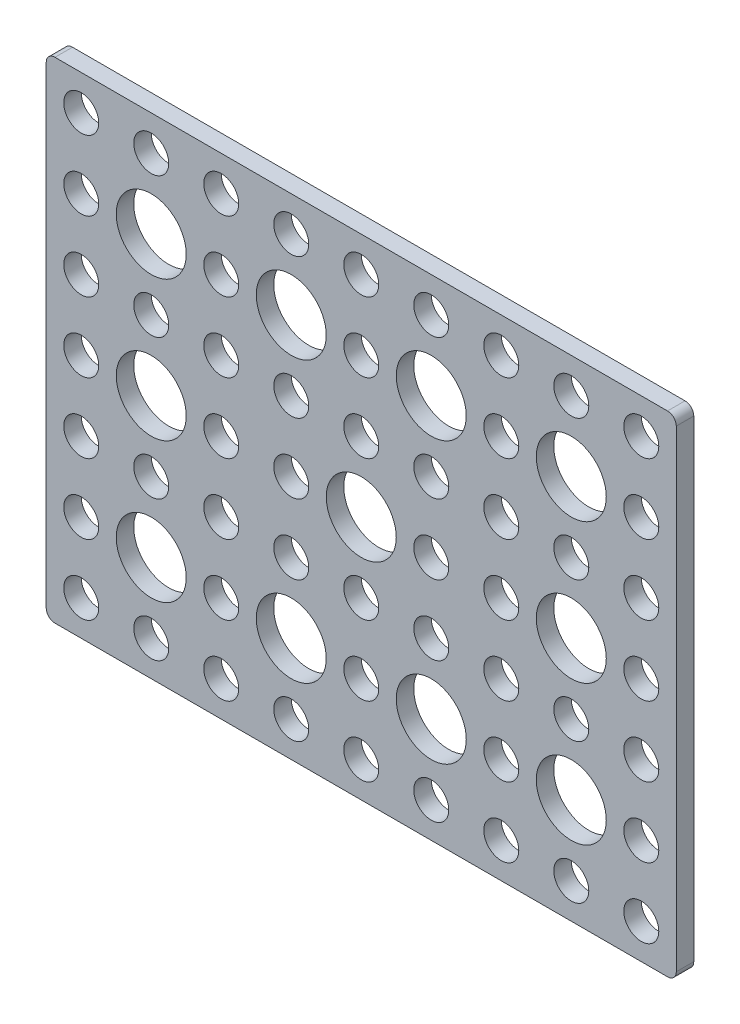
ISO-10303-21;
HEADER;
FILE_DESCRIPTION(('STEP AP214'),'2;1');
FILE_NAME('part.step','',(''),(''),'','','');
FILE_SCHEMA(('AUTOMOTIVE_DESIGN { 1 0 10303 214 1 1 1 1 }'));
ENDSEC;
DATA;
#1=APPLICATION_CONTEXT('core data for automotive mechanical design processes');
#2=APPLICATION_PROTOCOL_DEFINITION('international standard','automotive_design',2000,#1);
#3=PRODUCT_CONTEXT('',#1,'mechanical');
#4=PRODUCT('Part','Part','',(#3));
#5=PRODUCT_RELATED_PRODUCT_CATEGORY('part','',(#4));
#6=PRODUCT_DEFINITION_FORMATION('','',#4);
#7=PRODUCT_DEFINITION_CONTEXT('part definition',#1,'design');
#8=PRODUCT_DEFINITION('design','',#6,#7);
#9=PRODUCT_DEFINITION_SHAPE('','',#8);
#10=(LENGTH_UNIT() NAMED_UNIT(*) SI_UNIT(.MILLI.,.METRE.));
#11=(NAMED_UNIT(*) PLANE_ANGLE_UNIT() SI_UNIT($,.RADIAN.));
#12=(NAMED_UNIT(*) SI_UNIT($,.STERADIAN.) SOLID_ANGLE_UNIT());
#13=UNCERTAINTY_MEASURE_WITH_UNIT(LENGTH_MEASURE(1.E-05),#10,'distance_accuracy_value','');
#14=(GEOMETRIC_REPRESENTATION_CONTEXT(3) GLOBAL_UNCERTAINTY_ASSIGNED_CONTEXT((#13)) GLOBAL_UNIT_ASSIGNED_CONTEXT((#10,
#11,#12)) REPRESENTATION_CONTEXT('',''));
#15=CARTESIAN_POINT('',(0.,0.,0.));
#16=DIRECTION('',(0.,0.,1.));
#17=DIRECTION('',(1.,0.,0.));
#18=AXIS2_PLACEMENT_3D('',#15,#16,#17);
#19=CARTESIAN_POINT('',(0.,0.,2.));
#20=DIRECTION('',(0.,0.,1.));
#21=DIRECTION('',(1.,0.,0.));
#22=AXIS2_PLACEMENT_3D('',#19,#20,#21);
#23=PLANE('',#22);
#24=CARTESIAN_POINT('',(-68.0000000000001,43.9999999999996,2.));
#25=DIRECTION('',(0.,0.,1.));
#26=DIRECTION('',(1.,0.,0.));
#27=AXIS2_PLACEMENT_3D('',#24,#25,#26);
#28=CIRCLE('',#27,2.);
#29=CARTESIAN_POINT('',(-66.0000000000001,43.9999999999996,2.));
#30=VERTEX_POINT('',#29);
#31=EDGE_CURVE('E540',#30,#30,#28,.T.);
#32=ORIENTED_EDGE('',*,*,#31,.F.);
#33=EDGE_LOOP('',(#32));
#34=FACE_BOUND('',#33,.T.);
#35=CARTESIAN_POINT('',(-68.0000000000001,27.9999999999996,2.));
#36=DIRECTION('',(0.,0.,1.));
#37=DIRECTION('',(1.,0.,0.));
#38=AXIS2_PLACEMENT_3D('',#35,#36,#37);
#39=CIRCLE('',#38,2.00000000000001);
#40=CARTESIAN_POINT('',(-66.0000000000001,27.9999999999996,2.));
#41=VERTEX_POINT('',#40);
#42=EDGE_CURVE('E528',#41,#41,#39,.T.);
#43=ORIENTED_EDGE('',*,*,#42,.F.);
#44=EDGE_LOOP('',(#43));
#45=FACE_BOUND('',#44,.T.);
#46=CARTESIAN_POINT('',(-68.,11.9999999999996,2.));
#47=DIRECTION('',(0.,0.,1.));
#48=DIRECTION('',(1.,0.,0.));
#49=AXIS2_PLACEMENT_3D('',#46,#47,#48);
#50=CIRCLE('',#49,2.00000000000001);
#51=CARTESIAN_POINT('',(-66.,11.9999999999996,2.));
#52=VERTEX_POINT('',#51);
#53=EDGE_CURVE('E516',#52,#52,#50,.T.);
#54=ORIENTED_EDGE('',*,*,#53,.F.);
#55=EDGE_LOOP('',(#54));
#56=FACE_BOUND('',#55,.T.);
#57=CARTESIAN_POINT('',(-60.0000000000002,51.9999999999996,2.));
#58=DIRECTION('',(0.,0.,1.));
#59=DIRECTION('',(1.,0.,0.));
#60=AXIS2_PLACEMENT_3D('',#57,#58,#59);
#61=CIRCLE('',#60,2.);
#62=CARTESIAN_POINT('',(-58.0000000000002,51.9999999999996,2.));
#63=VERTEX_POINT('',#62);
#64=EDGE_CURVE('E504',#63,#63,#61,.T.);
#65=ORIENTED_EDGE('',*,*,#64,.F.);
#66=EDGE_LOOP('',(#65));
#67=FACE_BOUND('',#66,.T.);
#68=CARTESIAN_POINT('',(-60.0000000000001,19.9999999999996,2.));
#69=DIRECTION('',(0.,0.,1.));
#70=DIRECTION('',(1.,0.,0.));
#71=AXIS2_PLACEMENT_3D('',#68,#69,#70);
#72=CIRCLE('',#71,2.);
#73=CARTESIAN_POINT('',(-58.0000000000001,19.9999999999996,2.));
#74=VERTEX_POINT('',#73);
#75=EDGE_CURVE('E492',#74,#74,#72,.T.);
#76=ORIENTED_EDGE('',*,*,#75,.F.);
#77=EDGE_LOOP('',(#76));
#78=FACE_BOUND('',#77,.T.);
#79=CARTESIAN_POINT('',(-52.0000000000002,51.9999999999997,2.));
#80=DIRECTION('',(0.,0.,1.));
#81=DIRECTION('',(1.,0.,0.));
#82=AXIS2_PLACEMENT_3D('',#79,#80,#81);
#83=CIRCLE('',#82,2.);
#84=CARTESIAN_POINT('',(-50.0000000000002,51.9999999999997,2.));
#85=VERTEX_POINT('',#84);
#86=EDGE_CURVE('E480',#85,#85,#83,.T.);
#87=ORIENTED_EDGE('',*,*,#86,.F.);
#88=EDGE_LOOP('',(#87));
#89=FACE_BOUND('',#88,.T.);
#90=CARTESIAN_POINT('',(-52.0000000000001,35.9999999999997,2.));
#91=DIRECTION('',(0.,0.,1.));
#92=DIRECTION('',(1.,0.,0.));
#93=AXIS2_PLACEMENT_3D('',#90,#91,#92);
#94=CIRCLE('',#93,2.);
#95=CARTESIAN_POINT('',(-50.0000000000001,35.9999999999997,2.));
#96=VERTEX_POINT('',#95);
#97=EDGE_CURVE('E468',#96,#96,#94,.T.);
#98=ORIENTED_EDGE('',*,*,#97,.F.);
#99=EDGE_LOOP('',(#98));
#100=FACE_BOUND('',#99,.T.);
#101=CARTESIAN_POINT('',(-52.0000000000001,19.9999999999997,2.));
#102=DIRECTION('',(0.,0.,1.));
#103=DIRECTION('',(1.,0.,0.));
#104=AXIS2_PLACEMENT_3D('',#101,#102,#103);
#105=CIRCLE('',#104,2.);
#106=CARTESIAN_POINT('',(-50.0000000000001,19.9999999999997,2.));
#107=VERTEX_POINT('',#106);
#108=EDGE_CURVE('E456',#107,#107,#105,.T.);
#109=ORIENTED_EDGE('',*,*,#108,.F.);
#110=EDGE_LOOP('',(#109));
#111=FACE_BOUND('',#110,.T.);
#112=CARTESIAN_POINT('',(-52.,3.99999999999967,2.));
#113=DIRECTION('',(0.,0.,1.));
#114=DIRECTION('',(1.,0.,0.));
#115=AXIS2_PLACEMENT_3D('',#112,#113,#114);
#116=CIRCLE('',#115,2.);
#117=CARTESIAN_POINT('',(-50.,3.99999999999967,2.));
#118=VERTEX_POINT('',#117);
#119=EDGE_CURVE('E444',#118,#118,#116,.T.);
#120=ORIENTED_EDGE('',*,*,#119,.F.);
#121=EDGE_LOOP('',(#120));
#122=FACE_BOUND('',#121,.T.);
#123=CARTESIAN_POINT('',(-44.0000000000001,35.9999999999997,2.));
#124=DIRECTION('',(0.,0.,1.));
#125=DIRECTION('',(1.,0.,0.));
#126=AXIS2_PLACEMENT_3D('',#123,#124,#125);
#127=CIRCLE('',#126,2.);
#128=CARTESIAN_POINT('',(-42.0000000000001,35.9999999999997,2.));
#129=VERTEX_POINT('',#128);
#130=EDGE_CURVE('E432',#129,#129,#127,.T.);
#131=ORIENTED_EDGE('',*,*,#130,.F.);
#132=EDGE_LOOP('',(#131));
#133=FACE_BOUND('',#132,.T.);
#134=CARTESIAN_POINT('',(-44.,19.9999999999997,2.));
#135=DIRECTION('',(0.,0.,1.));
#136=DIRECTION('',(1.,0.,0.));
#137=AXIS2_PLACEMENT_3D('',#134,#135,#136);
#138=CIRCLE('',#137,2.);
#139=CARTESIAN_POINT('',(-42.0000000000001,19.9999999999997,2.));
#140=VERTEX_POINT('',#139);
#141=EDGE_CURVE('E420',#140,#140,#138,.T.);
#142=ORIENTED_EDGE('',*,*,#141,.F.);
#143=EDGE_LOOP('',(#142));
#144=FACE_BOUND('',#143,.T.);
#145=CARTESIAN_POINT('',(-36.0000000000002,51.9999999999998,2.));
#146=DIRECTION('',(0.,0.,1.));
#147=DIRECTION('',(1.,0.,0.));
#148=AXIS2_PLACEMENT_3D('',#145,#146,#147);
#149=CIRCLE('',#148,2.);
#150=CARTESIAN_POINT('',(-34.0000000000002,51.9999999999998,2.));
#151=VERTEX_POINT('',#150);
#152=EDGE_CURVE('E408',#151,#151,#149,.T.);
#153=ORIENTED_EDGE('',*,*,#152,.F.);
#154=EDGE_LOOP('',(#153));
#155=FACE_BOUND('',#154,.T.);
#156=CARTESIAN_POINT('',(-36.0000000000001,35.9999999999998,2.));
#157=DIRECTION('',(0.,0.,1.));
#158=DIRECTION('',(1.,0.,0.));
#159=AXIS2_PLACEMENT_3D('',#156,#157,#158);
#160=CIRCLE('',#159,2.);
#161=CARTESIAN_POINT('',(-34.0000000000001,35.9999999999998,2.));
#162=VERTEX_POINT('',#161);
#163=EDGE_CURVE('E396',#162,#162,#160,.T.);
#164=ORIENTED_EDGE('',*,*,#163,.F.);
#165=EDGE_LOOP('',(#164));
#166=FACE_BOUND('',#165,.T.);
#167=CARTESIAN_POINT('',(-36.,11.9999999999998,2.));
#168=DIRECTION('',(0.,0.,1.));
#169=DIRECTION('',(1.,0.,0.));
#170=AXIS2_PLACEMENT_3D('',#167,#168,#169);
#171=CIRCLE('',#170,2.);
#172=CARTESIAN_POINT('',(-34.,11.9999999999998,2.));
#173=VERTEX_POINT('',#172);
#174=EDGE_CURVE('E384',#173,#173,#171,.T.);
#175=ORIENTED_EDGE('',*,*,#174,.F.);
#176=EDGE_LOOP('',(#175));
#177=FACE_BOUND('',#176,.T.);
#178=CARTESIAN_POINT('',(-28.0000000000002,51.9999999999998,2.));
#179=DIRECTION('',(0.,0.,1.));
#180=DIRECTION('',(1.,0.,0.));
#181=AXIS2_PLACEMENT_3D('',#178,#179,#180);
#182=CIRCLE('',#181,2.);
#183=CARTESIAN_POINT('',(-26.0000000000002,51.9999999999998,2.));
#184=VERTEX_POINT('',#183);
#185=EDGE_CURVE('E372',#184,#184,#182,.T.);
#186=ORIENTED_EDGE('',*,*,#185,.F.);
#187=EDGE_LOOP('',(#186));
#188=FACE_BOUND('',#187,.T.);
#189=CARTESIAN_POINT('',(-28.0000000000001,35.9999999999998,2.));
#190=DIRECTION('',(0.,0.,1.));
#191=DIRECTION('',(1.,0.,0.));
#192=AXIS2_PLACEMENT_3D('',#189,#190,#191);
#193=CIRCLE('',#192,2.);
#194=CARTESIAN_POINT('',(-26.0000000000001,35.9999999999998,2.));
#195=VERTEX_POINT('',#194);
#196=EDGE_CURVE('E360',#195,#195,#193,.T.);
#197=ORIENTED_EDGE('',*,*,#196,.F.);
#198=EDGE_LOOP('',(#197));
#199=FACE_BOUND('',#198,.T.);
#200=CARTESIAN_POINT('',(-28.0000000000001,19.9999999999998,2.));
#201=DIRECTION('',(0.,0.,1.));
#202=DIRECTION('',(1.,0.,0.));
#203=AXIS2_PLACEMENT_3D('',#200,#201,#202);
#204=CIRCLE('',#203,2.);
#205=CARTESIAN_POINT('',(-26.0000000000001,19.9999999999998,2.));
#206=VERTEX_POINT('',#205);
#207=EDGE_CURVE('E348',#206,#206,#204,.T.);
#208=ORIENTED_EDGE('',*,*,#207,.F.);
#209=EDGE_LOOP('',(#208));
#210=FACE_BOUND('',#209,.T.);
#211=CARTESIAN_POINT('',(-28.,3.99999999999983,2.));
#212=DIRECTION('',(0.,0.,1.));
#213=DIRECTION('',(1.,0.,0.));
#214=AXIS2_PLACEMENT_3D('',#211,#212,#213);
#215=CIRCLE('',#214,2.);
#216=CARTESIAN_POINT('',(-26.,3.99999999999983,2.));
#217=VERTEX_POINT('',#216);
#218=EDGE_CURVE('E336',#217,#217,#215,.T.);
#219=ORIENTED_EDGE('',*,*,#218,.F.);
#220=EDGE_LOOP('',(#219));
#221=FACE_BOUND('',#220,.T.);
#222=CARTESIAN_POINT('',(-20.0000000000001,43.9999999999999,2.));
#223=DIRECTION('',(0.,0.,1.));
#224=DIRECTION('',(1.,0.,0.));
#225=AXIS2_PLACEMENT_3D('',#222,#223,#224);
#226=CIRCLE('',#225,2.);
#227=CARTESIAN_POINT('',(-18.0000000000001,43.9999999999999,2.));
#228=VERTEX_POINT('',#227);
#229=EDGE_CURVE('E324',#228,#228,#226,.T.);
#230=ORIENTED_EDGE('',*,*,#229,.F.);
#231=EDGE_LOOP('',(#230));
#232=FACE_BOUND('',#231,.T.);
#233=CARTESIAN_POINT('',(-20.0000000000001,27.9999999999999,2.));
#234=DIRECTION('',(0.,0.,1.));
#235=DIRECTION('',(1.,0.,0.));
#236=AXIS2_PLACEMENT_3D('',#233,#234,#235);
#237=CIRCLE('',#236,2.);
#238=CARTESIAN_POINT('',(-18.0000000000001,27.9999999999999,2.));
#239=VERTEX_POINT('',#238);
#240=EDGE_CURVE('E312',#239,#239,#237,.T.);
#241=ORIENTED_EDGE('',*,*,#240,.F.);
#242=EDGE_LOOP('',(#241));
#243=FACE_BOUND('',#242,.T.);
#244=CARTESIAN_POINT('',(-20.,11.9999999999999,2.));
#245=DIRECTION('',(0.,0.,1.));
#246=DIRECTION('',(1.,0.,0.));
#247=AXIS2_PLACEMENT_3D('',#244,#245,#246);
#248=CIRCLE('',#247,2.);
#249=CARTESIAN_POINT('',(-18.,11.9999999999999,2.));
#250=VERTEX_POINT('',#249);
#251=EDGE_CURVE('E300',#250,#250,#248,.T.);
#252=ORIENTED_EDGE('',*,*,#251,.F.);
#253=EDGE_LOOP('',(#252));
#254=FACE_BOUND('',#253,.T.);
#255=CARTESIAN_POINT('',(-11.9999999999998,11.9999999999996,2.));
#256=DIRECTION('',(0.,0.,1.));
#257=DIRECTION('',(1.,0.,0.));
#258=AXIS2_PLACEMENT_3D('',#255,#256,#257);
#259=CIRCLE('',#258,4.);
#260=CARTESIAN_POINT('',(-7.99999999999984,11.9999999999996,2.));
#261=VERTEX_POINT('',#260);
#262=EDGE_CURVE('E288',#261,#261,#259,.T.);
#263=ORIENTED_EDGE('',*,*,#262,.F.);
#264=EDGE_LOOP('',(#263));
#265=FACE_BOUND('',#264,.T.);
#266=CARTESIAN_POINT('',(-43.9999999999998,11.9999999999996,2.));
#267=DIRECTION('',(0.,0.,1.));
#268=DIRECTION('',(1.,0.,0.));
#269=AXIS2_PLACEMENT_3D('',#266,#267,#268);
#270=CIRCLE('',#269,4.);
#271=CARTESIAN_POINT('',(-39.9999999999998,11.9999999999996,2.));
#272=VERTEX_POINT('',#271);
#273=EDGE_CURVE('E276',#272,#272,#270,.T.);
#274=ORIENTED_EDGE('',*,*,#273,.F.);
#275=EDGE_LOOP('',(#274));
#276=FACE_BOUND('',#275,.T.);
#277=CARTESIAN_POINT('',(-12.0000000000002,43.9999999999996,2.));
#278=DIRECTION('',(0.,0.,1.));
#279=DIRECTION('',(1.,0.,0.));
#280=AXIS2_PLACEMENT_3D('',#277,#278,#279);
#281=CIRCLE('',#280,4.);
#282=CARTESIAN_POINT('',(-8.00000000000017,43.9999999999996,2.));
#283=VERTEX_POINT('',#282);
#284=EDGE_CURVE('E264',#283,#283,#281,.T.);
#285=ORIENTED_EDGE('',*,*,#284,.F.);
#286=EDGE_LOOP('',(#285));
#287=FACE_BOUND('',#286,.T.);
#288=CARTESIAN_POINT('',(-20.,3.99999999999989,2.));
#289=DIRECTION('',(0.,0.,1.));
#290=DIRECTION('',(1.,0.,0.));
#291=AXIS2_PLACEMENT_3D('',#288,#289,#290);
#292=CIRCLE('',#291,2.);
#293=CARTESIAN_POINT('',(-18.,3.99999999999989,2.));
#294=VERTEX_POINT('',#293);
#295=EDGE_CURVE('E252',#294,#294,#292,.T.);
#296=ORIENTED_EDGE('',*,*,#295,.F.);
#297=EDGE_LOOP('',(#296));
#298=FACE_BOUND('',#297,.T.);
#299=CARTESIAN_POINT('',(-12.0000000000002,52.,2.));
#300=DIRECTION('',(0.,0.,1.));
#301=DIRECTION('',(1.,0.,0.));
#302=AXIS2_PLACEMENT_3D('',#299,#300,#301);
#303=CIRCLE('',#302,2.);
#304=CARTESIAN_POINT('',(-10.0000000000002,52.,2.));
#305=VERTEX_POINT('',#304);
#306=EDGE_CURVE('E240',#305,#305,#303,.T.);
#307=ORIENTED_EDGE('',*,*,#306,.F.);
#308=EDGE_LOOP('',(#307));
#309=FACE_BOUND('',#308,.T.);
#310=CARTESIAN_POINT('',(-4.00000000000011,36.,2.));
#311=DIRECTION('',(0.,0.,1.));
#312=DIRECTION('',(1.,0.,0.));
#313=AXIS2_PLACEMENT_3D('',#310,#311,#312);
#314=CIRCLE('',#313,2.);
#315=CARTESIAN_POINT('',(-2.00000000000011,36.,2.));
#316=VERTEX_POINT('',#315);
#317=EDGE_CURVE('E228',#316,#316,#314,.T.);
#318=ORIENTED_EDGE('',*,*,#317,.F.);
#319=EDGE_LOOP('',(#318));
#320=FACE_BOUND('',#319,.T.);
#321=CARTESIAN_POINT('',(-12.0000000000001,36.,2.));
#322=DIRECTION('',(0.,0.,1.));
#323=DIRECTION('',(1.,0.,0.));
#324=AXIS2_PLACEMENT_3D('',#321,#322,#323);
#325=CIRCLE('',#324,2.);
#326=CARTESIAN_POINT('',(-10.0000000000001,36.,2.));
#327=VERTEX_POINT('',#326);
#328=EDGE_CURVE('E216',#327,#327,#325,.T.);
#329=ORIENTED_EDGE('',*,*,#328,.F.);
#330=EDGE_LOOP('',(#329));
#331=FACE_BOUND('',#330,.T.);
#332=CARTESIAN_POINT('',(-4.00000000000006,20.,2.));
#333=DIRECTION('',(0.,0.,1.));
#334=DIRECTION('',(1.,0.,0.));
#335=AXIS2_PLACEMENT_3D('',#332,#333,#334);
#336=CIRCLE('',#335,2.);
#337=CARTESIAN_POINT('',(-2.00000000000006,20.,2.));
#338=VERTEX_POINT('',#337);
#339=EDGE_CURVE('E204',#338,#338,#336,.T.);
#340=ORIENTED_EDGE('',*,*,#339,.F.);
#341=EDGE_LOOP('',(#340));
#342=FACE_BOUND('',#341,.T.);
#343=CARTESIAN_POINT('',(-12.0000000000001,19.9999999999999,2.));
#344=DIRECTION('',(0.,0.,1.));
#345=DIRECTION('',(1.,0.,0.));
#346=AXIS2_PLACEMENT_3D('',#343,#344,#345);
#347=CIRCLE('',#346,2.);
#348=CARTESIAN_POINT('',(-10.0000000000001,19.9999999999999,2.));
#349=VERTEX_POINT('',#348);
#350=EDGE_CURVE('E192',#349,#349,#347,.T.);
#351=ORIENTED_EDGE('',*,*,#350,.F.);
#352=EDGE_LOOP('',(#351));
#353=FACE_BOUND('',#352,.T.);
#354=CARTESIAN_POINT('',(-12.,3.99999999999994,2.));
#355=DIRECTION('',(0.,0.,1.));
#356=DIRECTION('',(1.,0.,0.));
#357=AXIS2_PLACEMENT_3D('',#354,#355,#356);
#358=CIRCLE('',#357,2.);
#359=CARTESIAN_POINT('',(-10.,3.99999999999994,2.));
#360=VERTEX_POINT('',#359);
#361=EDGE_CURVE('E181',#360,#360,#358,.T.);
#362=ORIENTED_EDGE('',*,*,#361,.F.);
#363=EDGE_LOOP('',(#362));
#364=FACE_BOUND('',#363,.T.);
#365=DIRECTION('',(0.,-1.,0.));
#366=VECTOR('',#365,1.);
#367=CARTESIAN_POINT('',(-72.,0.,2.));
#368=LINE('',#367,#366);
#369=CARTESIAN_POINT('',(-72.,55.,2.));
#370=VERTEX_POINT('',#369);
#371=CARTESIAN_POINT('',(-72.,1.,2.));
#372=VERTEX_POINT('',#371);
#373=EDGE_CURVE('E128',#370,#372,#368,.T.);
#374=ORIENTED_EDGE('',*,*,#373,.T.);
#375=CARTESIAN_POINT('',(-71.,1.,2.));
#376=DIRECTION('',(0.,0.,1.));
#377=DIRECTION('',(1.,0.,0.));
#378=AXIS2_PLACEMENT_3D('',#375,#376,#377);
#379=CIRCLE('',#378,1.);
#380=CARTESIAN_POINT('',(-71.,0.,2.));
#381=VERTEX_POINT('',#380);
#382=EDGE_CURVE('E11',#372,#381,#379,.T.);
#383=ORIENTED_EDGE('',*,*,#382,.T.);
#384=DIRECTION('',(1.,0.,0.));
#385=VECTOR('',#384,1.);
#386=CARTESIAN_POINT('',(0.,0.,2.));
#387=LINE('',#386,#385);
#388=CARTESIAN_POINT('',(-1.,0.,2.));
#389=VERTEX_POINT('',#388);
#390=EDGE_CURVE('E161',#381,#389,#387,.T.);
#391=ORIENTED_EDGE('',*,*,#390,.T.);
#392=CARTESIAN_POINT('',(-1.,1.,2.));
#393=DIRECTION('',(0.,0.,1.));
#394=DIRECTION('',(1.,0.,0.));
#395=AXIS2_PLACEMENT_3D('',#392,#393,#394);
#396=CIRCLE('',#395,1.);
#397=CARTESIAN_POINT('',(0.,1.,2.));
#398=VERTEX_POINT('',#397);
#399=EDGE_CURVE('E135',#389,#398,#396,.T.);
#400=ORIENTED_EDGE('',*,*,#399,.T.);
#401=DIRECTION('',(0.,1.,0.));
#402=VECTOR('',#401,1.);
#403=CARTESIAN_POINT('',(0.,56.,2.));
#404=LINE('',#403,#402);
#405=CARTESIAN_POINT('',(0.,55.,2.));
#406=VERTEX_POINT('',#405);
#407=EDGE_CURVE('E117',#398,#406,#404,.T.);
#408=ORIENTED_EDGE('',*,*,#407,.T.);
#409=CARTESIAN_POINT('',(-1.,55.,2.));
#410=DIRECTION('',(0.,0.,1.));
#411=DIRECTION('',(1.,0.,0.));
#412=AXIS2_PLACEMENT_3D('',#409,#410,#411);
#413=CIRCLE('',#412,1.);
#414=CARTESIAN_POINT('',(-1.,56.,2.));
#415=VERTEX_POINT('',#414);
#416=EDGE_CURVE('E143',#406,#415,#413,.T.);
#417=ORIENTED_EDGE('',*,*,#416,.T.);
#418=DIRECTION('',(-1.,0.,0.));
#419=VECTOR('',#418,1.);
#420=CARTESIAN_POINT('',(0.,56.,2.));
#421=LINE('',#420,#419);
#422=CARTESIAN_POINT('',(-71.,56.,2.));
#423=VERTEX_POINT('',#422);
#424=EDGE_CURVE('E118',#415,#423,#421,.T.);
#425=ORIENTED_EDGE('',*,*,#424,.T.);
#426=CARTESIAN_POINT('',(-71.,55.,2.));
#427=DIRECTION('',(0.,0.,1.));
#428=DIRECTION('',(1.,0.,0.));
#429=AXIS2_PLACEMENT_3D('',#426,#427,#428);
#430=CIRCLE('',#429,1.);
#431=EDGE_CURVE('E152',#423,#370,#430,.T.);
#432=ORIENTED_EDGE('',*,*,#431,.T.);
#433=EDGE_LOOP('',(#374,#383,#391,#400,#408,#417,#425,#432));
#434=FACE_BOUND('',#433,.T.);
#435=CARTESIAN_POINT('',(-4.,4.,2.));
#436=DIRECTION('',(0.,0.,1.));
#437=DIRECTION('',(1.,0.,0.));
#438=AXIS2_PLACEMENT_3D('',#435,#436,#437);
#439=CIRCLE('',#438,2.);
#440=CARTESIAN_POINT('',(-2.,4.,2.));
#441=VERTEX_POINT('',#440);
#442=EDGE_CURVE('E176',#441,#441,#439,.T.);
#443=ORIENTED_EDGE('',*,*,#442,.F.);
#444=EDGE_LOOP('',(#443));
#445=FACE_BOUND('',#444,.T.);
#446=CARTESIAN_POINT('',(-60.0000000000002,43.9999999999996,2.));
#447=DIRECTION('',(0.,0.,1.));
#448=DIRECTION('',(1.,0.,0.));
#449=AXIS2_PLACEMENT_3D('',#446,#447,#448);
#450=CIRCLE('',#449,4.);
#451=CARTESIAN_POINT('',(-56.0000000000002,43.9999999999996,2.));
#452=VERTEX_POINT('',#451);
#453=EDGE_CURVE('E186',#452,#452,#450,.T.);
#454=ORIENTED_EDGE('',*,*,#453,.F.);
#455=EDGE_LOOP('',(#454));
#456=FACE_BOUND('',#455,.T.);
#457=CARTESIAN_POINT('',(-4.00000000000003,12.,2.));
#458=DIRECTION('',(0.,0.,1.));
#459=DIRECTION('',(1.,0.,0.));
#460=AXIS2_PLACEMENT_3D('',#457,#458,#459);
#461=CIRCLE('',#460,2.);
#462=CARTESIAN_POINT('',(-2.00000000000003,12.,2.));
#463=VERTEX_POINT('',#462);
#464=EDGE_CURVE('E198',#463,#463,#461,.T.);
#465=ORIENTED_EDGE('',*,*,#464,.F.);
#466=EDGE_LOOP('',(#465));
#467=FACE_BOUND('',#466,.T.);
#468=CARTESIAN_POINT('',(-44.0000000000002,43.9999999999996,2.));
#469=DIRECTION('',(0.,0.,1.));
#470=DIRECTION('',(1.,0.,0.));
#471=AXIS2_PLACEMENT_3D('',#468,#469,#470);
#472=CIRCLE('',#471,4.);
#473=CARTESIAN_POINT('',(-40.0000000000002,43.9999999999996,2.));
#474=VERTEX_POINT('',#473);
#475=EDGE_CURVE('E210',#474,#474,#472,.T.);
#476=ORIENTED_EDGE('',*,*,#475,.F.);
#477=EDGE_LOOP('',(#476));
#478=FACE_BOUND('',#477,.T.);
#479=CARTESIAN_POINT('',(-4.00000000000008,28.,2.));
#480=DIRECTION('',(0.,0.,1.));
#481=DIRECTION('',(1.,0.,0.));
#482=AXIS2_PLACEMENT_3D('',#479,#480,#481);
#483=CIRCLE('',#482,2.);
#484=CARTESIAN_POINT('',(-2.00000000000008,28.,2.));
#485=VERTEX_POINT('',#484);
#486=EDGE_CURVE('E222',#485,#485,#483,.T.);
#487=ORIENTED_EDGE('',*,*,#486,.F.);
#488=EDGE_LOOP('',(#487));
#489=FACE_BOUND('',#488,.T.);
#490=CARTESIAN_POINT('',(-28.0000000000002,43.9999999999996,2.));
#491=DIRECTION('',(0.,0.,1.));
#492=DIRECTION('',(1.,0.,0.));
#493=AXIS2_PLACEMENT_3D('',#490,#491,#492);
#494=CIRCLE('',#493,4.);
#495=CARTESIAN_POINT('',(-24.0000000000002,43.9999999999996,2.));
#496=VERTEX_POINT('',#495);
#497=EDGE_CURVE('E234',#496,#496,#494,.T.);
#498=ORIENTED_EDGE('',*,*,#497,.F.);
#499=EDGE_LOOP('',(#498));
#500=FACE_BOUND('',#499,.T.);
#501=CARTESIAN_POINT('',(-4.00000000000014,44.,2.));
#502=DIRECTION('',(0.,0.,1.));
#503=DIRECTION('',(1.,0.,0.));
#504=AXIS2_PLACEMENT_3D('',#501,#502,#503);
#505=CIRCLE('',#504,2.);
#506=CARTESIAN_POINT('',(-2.00000000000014,44.,2.));
#507=VERTEX_POINT('',#506);
#508=EDGE_CURVE('E246',#507,#507,#505,.T.);
#509=ORIENTED_EDGE('',*,*,#508,.F.);
#510=EDGE_LOOP('',(#509));
#511=FACE_BOUND('',#510,.T.);
#512=CARTESIAN_POINT('',(-4.00000000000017,52.,2.));
#513=DIRECTION('',(0.,0.,1.));
#514=DIRECTION('',(1.,0.,0.));
#515=AXIS2_PLACEMENT_3D('',#512,#513,#514);
#516=CIRCLE('',#515,2.);
#517=CARTESIAN_POINT('',(-2.00000000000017,52.,2.));
#518=VERTEX_POINT('',#517);
#519=EDGE_CURVE('E258',#518,#518,#516,.T.);
#520=ORIENTED_EDGE('',*,*,#519,.F.);
#521=EDGE_LOOP('',(#520));
#522=FACE_BOUND('',#521,.T.);
#523=CARTESIAN_POINT('',(-59.9999999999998,11.9999999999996,2.));
#524=DIRECTION('',(0.,0.,1.));
#525=DIRECTION('',(1.,0.,0.));
#526=AXIS2_PLACEMENT_3D('',#523,#524,#525);
#527=CIRCLE('',#526,4.);
#528=CARTESIAN_POINT('',(-55.9999999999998,11.9999999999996,2.));
#529=VERTEX_POINT('',#528);
#530=EDGE_CURVE('E270',#529,#529,#527,.T.);
#531=ORIENTED_EDGE('',*,*,#530,.F.);
#532=EDGE_LOOP('',(#531));
#533=FACE_BOUND('',#532,.T.);
#534=CARTESIAN_POINT('',(-27.9999999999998,11.9999999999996,2.));
#535=DIRECTION('',(0.,0.,1.));
#536=DIRECTION('',(1.,0.,0.));
#537=AXIS2_PLACEMENT_3D('',#534,#535,#536);
#538=CIRCLE('',#537,4.);
#539=CARTESIAN_POINT('',(-23.9999999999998,11.9999999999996,2.));
#540=VERTEX_POINT('',#539);
#541=EDGE_CURVE('E282',#540,#540,#538,.T.);
#542=ORIENTED_EDGE('',*,*,#541,.F.);
#543=EDGE_LOOP('',(#542));
#544=FACE_BOUND('',#543,.T.);
#545=CARTESIAN_POINT('',(-59.9999999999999,27.9999999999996,2.));
#546=DIRECTION('',(0.,0.,1.));
#547=DIRECTION('',(1.,0.,0.));
#548=AXIS2_PLACEMENT_3D('',#545,#546,#547);
#549=CIRCLE('',#548,4.);
#550=CARTESIAN_POINT('',(-55.9999999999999,27.9999999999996,2.));
#551=VERTEX_POINT('',#550);
#552=EDGE_CURVE('E294',#551,#551,#549,.T.);
#553=ORIENTED_EDGE('',*,*,#552,.F.);
#554=EDGE_LOOP('',(#553));
#555=FACE_BOUND('',#554,.T.);
#556=CARTESIAN_POINT('',(-20.0000000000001,19.9999999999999,2.));
#557=DIRECTION('',(0.,0.,1.));
#558=DIRECTION('',(1.,0.,0.));
#559=AXIS2_PLACEMENT_3D('',#556,#557,#558);
#560=CIRCLE('',#559,2.);
#561=CARTESIAN_POINT('',(-18.0000000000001,19.9999999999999,2.));
#562=VERTEX_POINT('',#561);
#563=EDGE_CURVE('E306',#562,#562,#560,.T.);
#564=ORIENTED_EDGE('',*,*,#563,.F.);
#565=EDGE_LOOP('',(#564));
#566=FACE_BOUND('',#565,.T.);
#567=CARTESIAN_POINT('',(-20.0000000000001,35.9999999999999,2.));
#568=DIRECTION('',(0.,0.,1.));
#569=DIRECTION('',(1.,0.,0.));
#570=AXIS2_PLACEMENT_3D('',#567,#568,#569);
#571=CIRCLE('',#570,2.);
#572=CARTESIAN_POINT('',(-18.0000000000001,35.9999999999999,2.));
#573=VERTEX_POINT('',#572);
#574=EDGE_CURVE('E318',#573,#573,#571,.T.);
#575=ORIENTED_EDGE('',*,*,#574,.F.);
#576=EDGE_LOOP('',(#575));
#577=FACE_BOUND('',#576,.T.);
#578=CARTESIAN_POINT('',(-20.0000000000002,51.9999999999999,2.));
#579=DIRECTION('',(0.,0.,1.));
#580=DIRECTION('',(1.,0.,0.));
#581=AXIS2_PLACEMENT_3D('',#578,#579,#580);
#582=CIRCLE('',#581,2.);
#583=CARTESIAN_POINT('',(-18.0000000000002,51.9999999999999,2.));
#584=VERTEX_POINT('',#583);
#585=EDGE_CURVE('E330',#584,#584,#582,.T.);
#586=ORIENTED_EDGE('',*,*,#585,.F.);
#587=EDGE_LOOP('',(#586));
#588=FACE_BOUND('',#587,.T.);
#589=CARTESIAN_POINT('',(-35.9999999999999,27.9999999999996,2.));
#590=DIRECTION('',(0.,0.,1.));
#591=DIRECTION('',(1.,0.,0.));
#592=AXIS2_PLACEMENT_3D('',#589,#590,#591);
#593=CIRCLE('',#592,4.);
#594=CARTESIAN_POINT('',(-31.9999999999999,27.9999999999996,2.));
#595=VERTEX_POINT('',#594);
#596=EDGE_CURVE('E342',#595,#595,#593,.T.);
#597=ORIENTED_EDGE('',*,*,#596,.F.);
#598=EDGE_LOOP('',(#597));
#599=FACE_BOUND('',#598,.T.);
#600=CARTESIAN_POINT('',(-28.0000000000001,27.9999999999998,2.));
#601=DIRECTION('',(0.,0.,1.));
#602=DIRECTION('',(1.,0.,0.));
#603=AXIS2_PLACEMENT_3D('',#600,#601,#602);
#604=CIRCLE('',#603,2.);
#605=CARTESIAN_POINT('',(-26.0000000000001,27.9999999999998,2.));
#606=VERTEX_POINT('',#605);
#607=EDGE_CURVE('E354',#606,#606,#604,.T.);
#608=ORIENTED_EDGE('',*,*,#607,.F.);
#609=EDGE_LOOP('',(#608));
#610=FACE_BOUND('',#609,.T.);
#611=CARTESIAN_POINT('',(-11.9999999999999,27.9999999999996,2.));
#612=DIRECTION('',(0.,0.,1.));
#613=DIRECTION('',(1.,0.,0.));
#614=AXIS2_PLACEMENT_3D('',#611,#612,#613);
#615=CIRCLE('',#614,4.);
#616=CARTESIAN_POINT('',(-7.9999999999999,27.9999999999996,2.));
#617=VERTEX_POINT('',#616);
#618=EDGE_CURVE('E366',#617,#617,#615,.T.);
#619=ORIENTED_EDGE('',*,*,#618,.F.);
#620=EDGE_LOOP('',(#619));
#621=FACE_BOUND('',#620,.T.);
#622=CARTESIAN_POINT('',(-36.,3.99999999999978,2.));
#623=DIRECTION('',(0.,0.,1.));
#624=DIRECTION('',(1.,0.,0.));
#625=AXIS2_PLACEMENT_3D('',#622,#623,#624);
#626=CIRCLE('',#625,2.);
#627=CARTESIAN_POINT('',(-34.,3.99999999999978,2.));
#628=VERTEX_POINT('',#627);
#629=EDGE_CURVE('E378',#628,#628,#626,.T.);
#630=ORIENTED_EDGE('',*,*,#629,.F.);
#631=EDGE_LOOP('',(#630));
#632=FACE_BOUND('',#631,.T.);
#633=CARTESIAN_POINT('',(-36.0000000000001,19.9999999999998,2.));
#634=DIRECTION('',(0.,0.,1.));
#635=DIRECTION('',(1.,0.,0.));
#636=AXIS2_PLACEMENT_3D('',#633,#634,#635);
#637=CIRCLE('',#636,2.);
#638=CARTESIAN_POINT('',(-34.0000000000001,19.9999999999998,2.));
#639=VERTEX_POINT('',#638);
#640=EDGE_CURVE('E390',#639,#639,#637,.T.);
#641=ORIENTED_EDGE('',*,*,#640,.F.);
#642=EDGE_LOOP('',(#641));
#643=FACE_BOUND('',#642,.T.);
#644=CARTESIAN_POINT('',(-36.0000000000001,43.9999999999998,2.));
#645=DIRECTION('',(0.,0.,1.));
#646=DIRECTION('',(1.,0.,0.));
#647=AXIS2_PLACEMENT_3D('',#644,#645,#646);
#648=CIRCLE('',#647,2.);
#649=CARTESIAN_POINT('',(-34.0000000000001,43.9999999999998,2.));
#650=VERTEX_POINT('',#649);
#651=EDGE_CURVE('E402',#650,#650,#648,.T.);
#652=ORIENTED_EDGE('',*,*,#651,.F.);
#653=EDGE_LOOP('',(#652));
#654=FACE_BOUND('',#653,.T.);
#655=CARTESIAN_POINT('',(-44.,3.99999999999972,2.));
#656=DIRECTION('',(0.,0.,1.));
#657=DIRECTION('',(1.,0.,0.));
#658=AXIS2_PLACEMENT_3D('',#655,#656,#657);
#659=CIRCLE('',#658,2.);
#660=CARTESIAN_POINT('',(-42.,3.99999999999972,2.));
#661=VERTEX_POINT('',#660);
#662=EDGE_CURVE('E414',#661,#661,#659,.T.);
#663=ORIENTED_EDGE('',*,*,#662,.F.);
#664=EDGE_LOOP('',(#663));
#665=FACE_BOUND('',#664,.T.);
#666=CARTESIAN_POINT('',(-44.0000000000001,27.9999999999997,2.));
#667=DIRECTION('',(0.,0.,1.));
#668=DIRECTION('',(1.,0.,0.));
#669=AXIS2_PLACEMENT_3D('',#666,#667,#668);
#670=CIRCLE('',#669,2.);
#671=CARTESIAN_POINT('',(-42.0000000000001,27.9999999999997,2.));
#672=VERTEX_POINT('',#671);
#673=EDGE_CURVE('E426',#672,#672,#670,.T.);
#674=ORIENTED_EDGE('',*,*,#673,.F.);
#675=EDGE_LOOP('',(#674));
#676=FACE_BOUND('',#675,.T.);
#677=CARTESIAN_POINT('',(-44.0000000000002,51.9999999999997,2.));
#678=DIRECTION('',(0.,0.,1.));
#679=DIRECTION('',(1.,0.,0.));
#680=AXIS2_PLACEMENT_3D('',#677,#678,#679);
#681=CIRCLE('',#680,2.);
#682=CARTESIAN_POINT('',(-42.0000000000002,51.9999999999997,2.));
#683=VERTEX_POINT('',#682);
#684=EDGE_CURVE('E438',#683,#683,#681,.T.);
#685=ORIENTED_EDGE('',*,*,#684,.F.);
#686=EDGE_LOOP('',(#685));
#687=FACE_BOUND('',#686,.T.);
#688=CARTESIAN_POINT('',(-52.,11.9999999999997,2.));
#689=DIRECTION('',(0.,0.,1.));
#690=DIRECTION('',(1.,0.,0.));
#691=AXIS2_PLACEMENT_3D('',#688,#689,#690);
#692=CIRCLE('',#691,2.);
#693=CARTESIAN_POINT('',(-50.,11.9999999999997,2.));
#694=VERTEX_POINT('',#693);
#695=EDGE_CURVE('E450',#694,#694,#692,.T.);
#696=ORIENTED_EDGE('',*,*,#695,.F.);
#697=EDGE_LOOP('',(#696));
#698=FACE_BOUND('',#697,.T.);
#699=CARTESIAN_POINT('',(-52.0000000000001,27.9999999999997,2.));
#700=DIRECTION('',(0.,0.,1.));
#701=DIRECTION('',(1.,0.,0.));
#702=AXIS2_PLACEMENT_3D('',#699,#700,#701);
#703=CIRCLE('',#702,2.);
#704=CARTESIAN_POINT('',(-50.0000000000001,27.9999999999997,2.));
#705=VERTEX_POINT('',#704);
#706=EDGE_CURVE('E462',#705,#705,#703,.T.);
#707=ORIENTED_EDGE('',*,*,#706,.F.);
#708=EDGE_LOOP('',(#707));
#709=FACE_BOUND('',#708,.T.);
#710=CARTESIAN_POINT('',(-52.0000000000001,43.9999999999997,2.));
#711=DIRECTION('',(0.,0.,1.));
#712=DIRECTION('',(1.,0.,0.));
#713=AXIS2_PLACEMENT_3D('',#710,#711,#712);
#714=CIRCLE('',#713,2.);
#715=CARTESIAN_POINT('',(-50.0000000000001,43.9999999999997,2.));
#716=VERTEX_POINT('',#715);
#717=EDGE_CURVE('E474',#716,#716,#714,.T.);
#718=ORIENTED_EDGE('',*,*,#717,.F.);
#719=EDGE_LOOP('',(#718));
#720=FACE_BOUND('',#719,.T.);
#721=CARTESIAN_POINT('',(-60.,3.99999999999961,2.));
#722=DIRECTION('',(0.,0.,1.));
#723=DIRECTION('',(1.,0.,0.));
#724=AXIS2_PLACEMENT_3D('',#721,#722,#723);
#725=CIRCLE('',#724,2.);
#726=CARTESIAN_POINT('',(-58.,3.99999999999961,2.));
#727=VERTEX_POINT('',#726);
#728=EDGE_CURVE('E486',#727,#727,#725,.T.);
#729=ORIENTED_EDGE('',*,*,#728,.F.);
#730=EDGE_LOOP('',(#729));
#731=FACE_BOUND('',#730,.T.);
#732=CARTESIAN_POINT('',(-60.0000000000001,35.9999999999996,2.));
#733=DIRECTION('',(0.,0.,1.));
#734=DIRECTION('',(1.,0.,0.));
#735=AXIS2_PLACEMENT_3D('',#732,#733,#734);
#736=CIRCLE('',#735,2.);
#737=CARTESIAN_POINT('',(-58.0000000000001,35.9999999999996,2.));
#738=VERTEX_POINT('',#737);
#739=EDGE_CURVE('E498',#738,#738,#736,.T.);
#740=ORIENTED_EDGE('',*,*,#739,.F.);
#741=EDGE_LOOP('',(#740));
#742=FACE_BOUND('',#741,.T.);
#743=CARTESIAN_POINT('',(-68.,3.99999999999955,2.));
#744=DIRECTION('',(0.,0.,1.));
#745=DIRECTION('',(1.,0.,0.));
#746=AXIS2_PLACEMENT_3D('',#743,#744,#745);
#747=CIRCLE('',#746,2.00000000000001);
#748=CARTESIAN_POINT('',(-66.,3.99999999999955,2.));
#749=VERTEX_POINT('',#748);
#750=EDGE_CURVE('E510',#749,#749,#747,.T.);
#751=ORIENTED_EDGE('',*,*,#750,.F.);
#752=EDGE_LOOP('',(#751));
#753=FACE_BOUND('',#752,.T.);
#754=CARTESIAN_POINT('',(-68.0000000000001,19.9999999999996,2.));
#755=DIRECTION('',(0.,0.,1.));
#756=DIRECTION('',(1.,0.,0.));
#757=AXIS2_PLACEMENT_3D('',#754,#755,#756);
#758=CIRCLE('',#757,2.00000000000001);
#759=CARTESIAN_POINT('',(-66.0000000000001,19.9999999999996,2.));
#760=VERTEX_POINT('',#759);
#761=EDGE_CURVE('E522',#760,#760,#758,.T.);
#762=ORIENTED_EDGE('',*,*,#761,.F.);
#763=EDGE_LOOP('',(#762));
#764=FACE_BOUND('',#763,.T.);
#765=CARTESIAN_POINT('',(-68.0000000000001,35.9999999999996,2.));
#766=DIRECTION('',(0.,0.,1.));
#767=DIRECTION('',(1.,0.,0.));
#768=AXIS2_PLACEMENT_3D('',#765,#766,#767);
#769=CIRCLE('',#768,1.99999999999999);
#770=CARTESIAN_POINT('',(-66.0000000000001,35.9999999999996,2.));
#771=VERTEX_POINT('',#770);
#772=EDGE_CURVE('E534',#771,#771,#769,.T.);
#773=ORIENTED_EDGE('',*,*,#772,.F.);
#774=EDGE_LOOP('',(#773));
#775=FACE_BOUND('',#774,.T.);
#776=CARTESIAN_POINT('',(-68.0000000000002,51.9999999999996,2.));
#777=DIRECTION('',(0.,0.,1.));
#778=DIRECTION('',(1.,0.,0.));
#779=AXIS2_PLACEMENT_3D('',#776,#777,#778);
#780=CIRCLE('',#779,1.99999999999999);
#781=CARTESIAN_POINT('',(-66.0000000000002,51.9999999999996,2.));
#782=VERTEX_POINT('',#781);
#783=EDGE_CURVE('E546',#782,#782,#780,.T.);
#784=ORIENTED_EDGE('',*,*,#783,.F.);
#785=EDGE_LOOP('',(#784));
#786=FACE_BOUND('',#785,.T.);
#787=ADVANCED_FACE('F35',(#34,#45,#56,#67,#78,#89,#100,#111,#122,#133,#144,#155,#166,#177,#188,
#199,#210,#221,#232,#243,#254,#265,#276,#287,#298,#309,#320,#331,#342,#353,#364,#434,#445,#456,
#467,#478,#489,#500,#511,#522,#533,#544,#555,#566,#577,#588,#599,#610,#621,#632,#643,#654,#665,
#676,#687,#698,#709,#720,#731,#742,#753,#764,#775,#786),#23,.T.);
#788=CARTESIAN_POINT('',(0.,0.,0.));
#789=DIRECTION('',(0.,0.,1.));
#790=DIRECTION('',(1.,0.,0.));
#791=AXIS2_PLACEMENT_3D('',#788,#789,#790);
#792=PLANE('',#791);
#793=DIRECTION('',(1.,0.,0.));
#794=VECTOR('',#793,1.);
#795=CARTESIAN_POINT('',(0.,0.,0.));
#796=LINE('',#795,#794);
#797=CARTESIAN_POINT('',(-71.,0.,0.));
#798=VERTEX_POINT('',#797);
#799=CARTESIAN_POINT('',(-1.,0.,0.));
#800=VERTEX_POINT('',#799);
#801=EDGE_CURVE('E125',#798,#800,#796,.T.);
#802=ORIENTED_EDGE('',*,*,#801,.F.);
#803=CARTESIAN_POINT('',(-71.,1.,0.));
#804=DIRECTION('',(0.,0.,1.));
#805=DIRECTION('',(1.,0.,0.));
#806=AXIS2_PLACEMENT_3D('',#803,#804,#805);
#807=CIRCLE('',#806,1.);
#808=CARTESIAN_POINT('',(-72.,1.,0.));
#809=VERTEX_POINT('',#808);
#810=EDGE_CURVE('E57',#798,#809,#807,.F.);
#811=ORIENTED_EDGE('',*,*,#810,.T.);
#812=DIRECTION('',(0.,-1.,0.));
#813=VECTOR('',#812,1.);
#814=CARTESIAN_POINT('',(-72.,0.,0.));
#815=LINE('',#814,#813);
#816=CARTESIAN_POINT('',(-72.,55.,0.));
#817=VERTEX_POINT('',#816);
#818=EDGE_CURVE('E130',#817,#809,#815,.T.);
#819=ORIENTED_EDGE('',*,*,#818,.F.);
#820=CARTESIAN_POINT('',(-71.,55.,0.));
#821=DIRECTION('',(0.,0.,1.));
#822=DIRECTION('',(1.,0.,0.));
#823=AXIS2_PLACEMENT_3D('',#820,#821,#822);
#824=CIRCLE('',#823,1.);
#825=CARTESIAN_POINT('',(-71.,56.,0.));
#826=VERTEX_POINT('',#825);
#827=EDGE_CURVE('E148',#817,#826,#824,.F.);
#828=ORIENTED_EDGE('',*,*,#827,.T.);
#829=DIRECTION('',(-1.,0.,0.));
#830=VECTOR('',#829,1.);
#831=CARTESIAN_POINT('',(0.,56.,0.));
#832=LINE('',#831,#830);
#833=CARTESIAN_POINT('',(-1.,56.,0.));
#834=VERTEX_POINT('',#833);
#835=EDGE_CURVE('E124',#834,#826,#832,.T.);
#836=ORIENTED_EDGE('',*,*,#835,.F.);
#837=CARTESIAN_POINT('',(-1.,55.,0.));
#838=DIRECTION('',(0.,0.,1.));
#839=DIRECTION('',(1.,0.,0.));
#840=AXIS2_PLACEMENT_3D('',#837,#838,#839);
#841=CIRCLE('',#840,1.);
#842=CARTESIAN_POINT('',(0.,55.,0.));
#843=VERTEX_POINT('',#842);
#844=EDGE_CURVE('E123',#834,#843,#841,.F.);
#845=ORIENTED_EDGE('',*,*,#844,.T.);
#846=DIRECTION('',(0.,1.,0.));
#847=VECTOR('',#846,1.);
#848=CARTESIAN_POINT('',(0.,56.,0.));
#849=LINE('',#848,#847);
#850=CARTESIAN_POINT('',(0.,1.,0.));
#851=VERTEX_POINT('',#850);
#852=EDGE_CURVE('E114',#851,#843,#849,.T.);
#853=ORIENTED_EDGE('',*,*,#852,.F.);
#854=CARTESIAN_POINT('',(-1.,1.,0.));
#855=DIRECTION('',(0.,0.,1.));
#856=DIRECTION('',(1.,0.,0.));
#857=AXIS2_PLACEMENT_3D('',#854,#855,#856);
#858=CIRCLE('',#857,1.);
#859=EDGE_CURVE('E101',#851,#800,#858,.F.);
#860=ORIENTED_EDGE('',*,*,#859,.T.);
#861=EDGE_LOOP('',(#802,#811,#819,#828,#836,#845,#853,#860));
#862=FACE_BOUND('',#861,.T.);
#863=CARTESIAN_POINT('',(-4.,4.,0.));
#864=DIRECTION('',(0.,0.,1.));
#865=DIRECTION('',(1.,0.,0.));
#866=AXIS2_PLACEMENT_3D('',#863,#864,#865);
#867=CIRCLE('',#866,2.);
#868=CARTESIAN_POINT('',(-2.,4.,0.));
#869=VERTEX_POINT('',#868);
#870=EDGE_CURVE('E172',#869,#869,#867,.T.);
#871=ORIENTED_EDGE('',*,*,#870,.T.);
#872=EDGE_LOOP('',(#871));
#873=FACE_BOUND('',#872,.T.);
#874=CARTESIAN_POINT('',(-12.,3.99999999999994,0.));
#875=DIRECTION('',(0.,0.,1.));
#876=DIRECTION('',(1.,0.,0.));
#877=AXIS2_PLACEMENT_3D('',#874,#875,#876);
#878=CIRCLE('',#877,2.);
#879=CARTESIAN_POINT('',(-10.,3.99999999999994,0.));
#880=VERTEX_POINT('',#879);
#881=EDGE_CURVE('E183',#880,#880,#878,.T.);
#882=ORIENTED_EDGE('',*,*,#881,.T.);
#883=EDGE_LOOP('',(#882));
#884=FACE_BOUND('',#883,.T.);
#885=CARTESIAN_POINT('',(-60.0000000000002,43.9999999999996,0.));
#886=DIRECTION('',(0.,0.,1.));
#887=DIRECTION('',(1.,0.,0.));
#888=AXIS2_PLACEMENT_3D('',#885,#886,#887);
#889=CIRCLE('',#888,4.);
#890=CARTESIAN_POINT('',(-56.0000000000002,43.9999999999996,0.));
#891=VERTEX_POINT('',#890);
#892=EDGE_CURVE('E189',#891,#891,#889,.T.);
#893=ORIENTED_EDGE('',*,*,#892,.T.);
#894=EDGE_LOOP('',(#893));
#895=FACE_BOUND('',#894,.T.);
#896=CARTESIAN_POINT('',(-12.0000000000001,19.9999999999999,0.));
#897=DIRECTION('',(0.,0.,1.));
#898=DIRECTION('',(1.,0.,0.));
#899=AXIS2_PLACEMENT_3D('',#896,#897,#898);
#900=CIRCLE('',#899,2.);
#901=CARTESIAN_POINT('',(-10.0000000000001,19.9999999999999,0.));
#902=VERTEX_POINT('',#901);
#903=EDGE_CURVE('E195',#902,#902,#900,.T.);
#904=ORIENTED_EDGE('',*,*,#903,.T.);
#905=EDGE_LOOP('',(#904));
#906=FACE_BOUND('',#905,.T.);
#907=CARTESIAN_POINT('',(-4.00000000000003,12.,0.));
#908=DIRECTION('',(0.,0.,1.));
#909=DIRECTION('',(1.,0.,0.));
#910=AXIS2_PLACEMENT_3D('',#907,#908,#909);
#911=CIRCLE('',#910,2.);
#912=CARTESIAN_POINT('',(-2.00000000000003,12.,0.));
#913=VERTEX_POINT('',#912);
#914=EDGE_CURVE('E201',#913,#913,#911,.T.);
#915=ORIENTED_EDGE('',*,*,#914,.T.);
#916=EDGE_LOOP('',(#915));
#917=FACE_BOUND('',#916,.T.);
#918=CARTESIAN_POINT('',(-4.00000000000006,20.,0.));
#919=DIRECTION('',(0.,0.,1.));
#920=DIRECTION('',(1.,0.,0.));
#921=AXIS2_PLACEMENT_3D('',#918,#919,#920);
#922=CIRCLE('',#921,2.);
#923=CARTESIAN_POINT('',(-2.00000000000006,20.,0.));
#924=VERTEX_POINT('',#923);
#925=EDGE_CURVE('E207',#924,#924,#922,.T.);
#926=ORIENTED_EDGE('',*,*,#925,.T.);
#927=EDGE_LOOP('',(#926));
#928=FACE_BOUND('',#927,.T.);
#929=CARTESIAN_POINT('',(-44.0000000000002,43.9999999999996,0.));
#930=DIRECTION('',(0.,0.,1.));
#931=DIRECTION('',(1.,0.,0.));
#932=AXIS2_PLACEMENT_3D('',#929,#930,#931);
#933=CIRCLE('',#932,4.);
#934=CARTESIAN_POINT('',(-40.0000000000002,43.9999999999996,0.));
#935=VERTEX_POINT('',#934);
#936=EDGE_CURVE('E213',#935,#935,#933,.T.);
#937=ORIENTED_EDGE('',*,*,#936,.T.);
#938=EDGE_LOOP('',(#937));
#939=FACE_BOUND('',#938,.T.);
#940=CARTESIAN_POINT('',(-12.0000000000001,36.,0.));
#941=DIRECTION('',(0.,0.,1.));
#942=DIRECTION('',(1.,0.,0.));
#943=AXIS2_PLACEMENT_3D('',#940,#941,#942);
#944=CIRCLE('',#943,2.);
#945=CARTESIAN_POINT('',(-10.0000000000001,36.,0.));
#946=VERTEX_POINT('',#945);
#947=EDGE_CURVE('E219',#946,#946,#944,.T.);
#948=ORIENTED_EDGE('',*,*,#947,.T.);
#949=EDGE_LOOP('',(#948));
#950=FACE_BOUND('',#949,.T.);
#951=CARTESIAN_POINT('',(-4.00000000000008,28.,0.));
#952=DIRECTION('',(0.,0.,1.));
#953=DIRECTION('',(1.,0.,0.));
#954=AXIS2_PLACEMENT_3D('',#951,#952,#953);
#955=CIRCLE('',#954,2.);
#956=CARTESIAN_POINT('',(-2.00000000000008,28.,0.));
#957=VERTEX_POINT('',#956);
#958=EDGE_CURVE('E225',#957,#957,#955,.T.);
#959=ORIENTED_EDGE('',*,*,#958,.T.);
#960=EDGE_LOOP('',(#959));
#961=FACE_BOUND('',#960,.T.);
#962=CARTESIAN_POINT('',(-4.00000000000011,36.,0.));
#963=DIRECTION('',(0.,0.,1.));
#964=DIRECTION('',(1.,0.,0.));
#965=AXIS2_PLACEMENT_3D('',#962,#963,#964);
#966=CIRCLE('',#965,2.);
#967=CARTESIAN_POINT('',(-2.00000000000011,36.,0.));
#968=VERTEX_POINT('',#967);
#969=EDGE_CURVE('E231',#968,#968,#966,.T.);
#970=ORIENTED_EDGE('',*,*,#969,.T.);
#971=EDGE_LOOP('',(#970));
#972=FACE_BOUND('',#971,.T.);
#973=CARTESIAN_POINT('',(-28.0000000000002,43.9999999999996,0.));
#974=DIRECTION('',(0.,0.,1.));
#975=DIRECTION('',(1.,0.,0.));
#976=AXIS2_PLACEMENT_3D('',#973,#974,#975);
#977=CIRCLE('',#976,4.);
#978=CARTESIAN_POINT('',(-24.0000000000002,43.9999999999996,0.));
#979=VERTEX_POINT('',#978);
#980=EDGE_CURVE('E237',#979,#979,#977,.T.);
#981=ORIENTED_EDGE('',*,*,#980,.T.);
#982=EDGE_LOOP('',(#981));
#983=FACE_BOUND('',#982,.T.);
#984=CARTESIAN_POINT('',(-12.0000000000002,52.,0.));
#985=DIRECTION('',(0.,0.,1.));
#986=DIRECTION('',(1.,0.,0.));
#987=AXIS2_PLACEMENT_3D('',#984,#985,#986);
#988=CIRCLE('',#987,2.);
#989=CARTESIAN_POINT('',(-10.0000000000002,52.,0.));
#990=VERTEX_POINT('',#989);
#991=EDGE_CURVE('E243',#990,#990,#988,.T.);
#992=ORIENTED_EDGE('',*,*,#991,.T.);
#993=EDGE_LOOP('',(#992));
#994=FACE_BOUND('',#993,.T.);
#995=CARTESIAN_POINT('',(-4.00000000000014,44.,0.));
#996=DIRECTION('',(0.,0.,1.));
#997=DIRECTION('',(1.,0.,0.));
#998=AXIS2_PLACEMENT_3D('',#995,#996,#997);
#999=CIRCLE('',#998,2.);
#1000=CARTESIAN_POINT('',(-2.00000000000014,44.,0.));
#1001=VERTEX_POINT('',#1000);
#1002=EDGE_CURVE('E249',#1001,#1001,#999,.T.);
#1003=ORIENTED_EDGE('',*,*,#1002,.T.);
#1004=EDGE_LOOP('',(#1003));
#1005=FACE_BOUND('',#1004,.T.);
#1006=CARTESIAN_POINT('',(-20.,3.99999999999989,0.));
#1007=DIRECTION('',(0.,0.,1.));
#1008=DIRECTION('',(1.,0.,0.));
#1009=AXIS2_PLACEMENT_3D('',#1006,#1007,#1008);
#1010=CIRCLE('',#1009,2.);
#1011=CARTESIAN_POINT('',(-18.,3.99999999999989,0.));
#1012=VERTEX_POINT('',#1011);
#1013=EDGE_CURVE('E255',#1012,#1012,#1010,.T.);
#1014=ORIENTED_EDGE('',*,*,#1013,.T.);
#1015=EDGE_LOOP('',(#1014));
#1016=FACE_BOUND('',#1015,.T.);
#1017=CARTESIAN_POINT('',(-4.00000000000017,52.,0.));
#1018=DIRECTION('',(0.,0.,1.));
#1019=DIRECTION('',(1.,0.,0.));
#1020=AXIS2_PLACEMENT_3D('',#1017,#1018,#1019);
#1021=CIRCLE('',#1020,2.);
#1022=CARTESIAN_POINT('',(-2.00000000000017,52.,0.));
#1023=VERTEX_POINT('',#1022);
#1024=EDGE_CURVE('E261',#1023,#1023,#1021,.T.);
#1025=ORIENTED_EDGE('',*,*,#1024,.T.);
#1026=EDGE_LOOP('',(#1025));
#1027=FACE_BOUND('',#1026,.T.);
#1028=CARTESIAN_POINT('',(-12.0000000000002,43.9999999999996,0.));
#1029=DIRECTION('',(0.,0.,1.));
#1030=DIRECTION('',(1.,0.,0.));
#1031=AXIS2_PLACEMENT_3D('',#1028,#1029,#1030);
#1032=CIRCLE('',#1031,4.);
#1033=CARTESIAN_POINT('',(-8.00000000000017,43.9999999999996,0.));
#1034=VERTEX_POINT('',#1033);
#1035=EDGE_CURVE('E267',#1034,#1034,#1032,.T.);
#1036=ORIENTED_EDGE('',*,*,#1035,.T.);
#1037=EDGE_LOOP('',(#1036));
#1038=FACE_BOUND('',#1037,.T.);
#1039=CARTESIAN_POINT('',(-59.9999999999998,11.9999999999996,0.));
#1040=DIRECTION('',(0.,0.,1.));
#1041=DIRECTION('',(1.,0.,0.));
#1042=AXIS2_PLACEMENT_3D('',#1039,#1040,#1041);
#1043=CIRCLE('',#1042,4.);
#1044=CARTESIAN_POINT('',(-55.9999999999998,11.9999999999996,0.));
#1045=VERTEX_POINT('',#1044);
#1046=EDGE_CURVE('E273',#1045,#1045,#1043,.T.);
#1047=ORIENTED_EDGE('',*,*,#1046,.T.);
#1048=EDGE_LOOP('',(#1047));
#1049=FACE_BOUND('',#1048,.T.);
#1050=CARTESIAN_POINT('',(-43.9999999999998,11.9999999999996,0.));
#1051=DIRECTION('',(0.,0.,1.));
#1052=DIRECTION('',(1.,0.,0.));
#1053=AXIS2_PLACEMENT_3D('',#1050,#1051,#1052);
#1054=CIRCLE('',#1053,4.);
#1055=CARTESIAN_POINT('',(-39.9999999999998,11.9999999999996,0.));
#1056=VERTEX_POINT('',#1055);
#1057=EDGE_CURVE('E279',#1056,#1056,#1054,.T.);
#1058=ORIENTED_EDGE('',*,*,#1057,.T.);
#1059=EDGE_LOOP('',(#1058));
#1060=FACE_BOUND('',#1059,.T.);
#1061=CARTESIAN_POINT('',(-27.9999999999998,11.9999999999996,0.));
#1062=DIRECTION('',(0.,0.,1.));
#1063=DIRECTION('',(1.,0.,0.));
#1064=AXIS2_PLACEMENT_3D('',#1061,#1062,#1063);
#1065=CIRCLE('',#1064,4.);
#1066=CARTESIAN_POINT('',(-23.9999999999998,11.9999999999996,0.));
#1067=VERTEX_POINT('',#1066);
#1068=EDGE_CURVE('E285',#1067,#1067,#1065,.T.);
#1069=ORIENTED_EDGE('',*,*,#1068,.T.);
#1070=EDGE_LOOP('',(#1069));
#1071=FACE_BOUND('',#1070,.T.);
#1072=CARTESIAN_POINT('',(-11.9999999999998,11.9999999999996,0.));
#1073=DIRECTION('',(0.,0.,1.));
#1074=DIRECTION('',(1.,0.,0.));
#1075=AXIS2_PLACEMENT_3D('',#1072,#1073,#1074);
#1076=CIRCLE('',#1075,4.);
#1077=CARTESIAN_POINT('',(-7.99999999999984,11.9999999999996,0.));
#1078=VERTEX_POINT('',#1077);
#1079=EDGE_CURVE('E291',#1078,#1078,#1076,.T.);
#1080=ORIENTED_EDGE('',*,*,#1079,.T.);
#1081=EDGE_LOOP('',(#1080));
#1082=FACE_BOUND('',#1081,.T.);
#1083=CARTESIAN_POINT('',(-59.9999999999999,27.9999999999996,0.));
#1084=DIRECTION('',(0.,0.,1.));
#1085=DIRECTION('',(1.,0.,0.));
#1086=AXIS2_PLACEMENT_3D('',#1083,#1084,#1085);
#1087=CIRCLE('',#1086,4.);
#1088=CARTESIAN_POINT('',(-55.9999999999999,27.9999999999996,0.));
#1089=VERTEX_POINT('',#1088);
#1090=EDGE_CURVE('E297',#1089,#1089,#1087,.T.);
#1091=ORIENTED_EDGE('',*,*,#1090,.T.);
#1092=EDGE_LOOP('',(#1091));
#1093=FACE_BOUND('',#1092,.T.);
#1094=CARTESIAN_POINT('',(-20.,11.9999999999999,0.));
#1095=DIRECTION('',(0.,0.,1.));
#1096=DIRECTION('',(1.,0.,0.));
#1097=AXIS2_PLACEMENT_3D('',#1094,#1095,#1096);
#1098=CIRCLE('',#1097,2.);
#1099=CARTESIAN_POINT('',(-18.,11.9999999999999,0.));
#1100=VERTEX_POINT('',#1099);
#1101=EDGE_CURVE('E303',#1100,#1100,#1098,.T.);
#1102=ORIENTED_EDGE('',*,*,#1101,.T.);
#1103=EDGE_LOOP('',(#1102));
#1104=FACE_BOUND('',#1103,.T.);
#1105=CARTESIAN_POINT('',(-20.0000000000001,19.9999999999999,0.));
#1106=DIRECTION('',(0.,0.,1.));
#1107=DIRECTION('',(1.,0.,0.));
#1108=AXIS2_PLACEMENT_3D('',#1105,#1106,#1107);
#1109=CIRCLE('',#1108,2.);
#1110=CARTESIAN_POINT('',(-18.0000000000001,19.9999999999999,0.));
#1111=VERTEX_POINT('',#1110);
#1112=EDGE_CURVE('E309',#1111,#1111,#1109,.T.);
#1113=ORIENTED_EDGE('',*,*,#1112,.T.);
#1114=EDGE_LOOP('',(#1113));
#1115=FACE_BOUND('',#1114,.T.);
#1116=CARTESIAN_POINT('',(-20.0000000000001,27.9999999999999,0.));
#1117=DIRECTION('',(0.,0.,1.));
#1118=DIRECTION('',(1.,0.,0.));
#1119=AXIS2_PLACEMENT_3D('',#1116,#1117,#1118);
#1120=CIRCLE('',#1119,2.);
#1121=CARTESIAN_POINT('',(-18.0000000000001,27.9999999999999,0.));
#1122=VERTEX_POINT('',#1121);
#1123=EDGE_CURVE('E315',#1122,#1122,#1120,.T.);
#1124=ORIENTED_EDGE('',*,*,#1123,.T.);
#1125=EDGE_LOOP('',(#1124));
#1126=FACE_BOUND('',#1125,.T.);
#1127=CARTESIAN_POINT('',(-20.0000000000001,35.9999999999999,0.));
#1128=DIRECTION('',(0.,0.,1.));
#1129=DIRECTION('',(1.,0.,0.));
#1130=AXIS2_PLACEMENT_3D('',#1127,#1128,#1129);
#1131=CIRCLE('',#1130,2.);
#1132=CARTESIAN_POINT('',(-18.0000000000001,35.9999999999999,0.));
#1133=VERTEX_POINT('',#1132);
#1134=EDGE_CURVE('E321',#1133,#1133,#1131,.T.);
#1135=ORIENTED_EDGE('',*,*,#1134,.T.);
#1136=EDGE_LOOP('',(#1135));
#1137=FACE_BOUND('',#1136,.T.);
#1138=CARTESIAN_POINT('',(-20.0000000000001,43.9999999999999,0.));
#1139=DIRECTION('',(0.,0.,1.));
#1140=DIRECTION('',(1.,0.,0.));
#1141=AXIS2_PLACEMENT_3D('',#1138,#1139,#1140);
#1142=CIRCLE('',#1141,2.);
#1143=CARTESIAN_POINT('',(-18.0000000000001,43.9999999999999,0.));
#1144=VERTEX_POINT('',#1143);
#1145=EDGE_CURVE('E327',#1144,#1144,#1142,.T.);
#1146=ORIENTED_EDGE('',*,*,#1145,.T.);
#1147=EDGE_LOOP('',(#1146));
#1148=FACE_BOUND('',#1147,.T.);
#1149=CARTESIAN_POINT('',(-20.0000000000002,51.9999999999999,0.));
#1150=DIRECTION('',(0.,0.,1.));
#1151=DIRECTION('',(1.,0.,0.));
#1152=AXIS2_PLACEMENT_3D('',#1149,#1150,#1151);
#1153=CIRCLE('',#1152,2.);
#1154=CARTESIAN_POINT('',(-18.0000000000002,51.9999999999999,0.));
#1155=VERTEX_POINT('',#1154);
#1156=EDGE_CURVE('E333',#1155,#1155,#1153,.T.);
#1157=ORIENTED_EDGE('',*,*,#1156,.T.);
#1158=EDGE_LOOP('',(#1157));
#1159=FACE_BOUND('',#1158,.T.);
#1160=CARTESIAN_POINT('',(-28.,3.99999999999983,0.));
#1161=DIRECTION('',(0.,0.,1.));
#1162=DIRECTION('',(1.,0.,0.));
#1163=AXIS2_PLACEMENT_3D('',#1160,#1161,#1162);
#1164=CIRCLE('',#1163,2.);
#1165=CARTESIAN_POINT('',(-26.,3.99999999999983,0.));
#1166=VERTEX_POINT('',#1165);
#1167=EDGE_CURVE('E339',#1166,#1166,#1164,.T.);
#1168=ORIENTED_EDGE('',*,*,#1167,.T.);
#1169=EDGE_LOOP('',(#1168));
#1170=FACE_BOUND('',#1169,.T.);
#1171=CARTESIAN_POINT('',(-35.9999999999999,27.9999999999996,0.));
#1172=DIRECTION('',(0.,0.,1.));
#1173=DIRECTION('',(1.,0.,0.));
#1174=AXIS2_PLACEMENT_3D('',#1171,#1172,#1173);
#1175=CIRCLE('',#1174,4.);
#1176=CARTESIAN_POINT('',(-31.9999999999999,27.9999999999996,0.));
#1177=VERTEX_POINT('',#1176);
#1178=EDGE_CURVE('E345',#1177,#1177,#1175,.T.);
#1179=ORIENTED_EDGE('',*,*,#1178,.T.);
#1180=EDGE_LOOP('',(#1179));
#1181=FACE_BOUND('',#1180,.T.);
#1182=CARTESIAN_POINT('',(-28.0000000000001,19.9999999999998,0.));
#1183=DIRECTION('',(0.,0.,1.));
#1184=DIRECTION('',(1.,0.,0.));
#1185=AXIS2_PLACEMENT_3D('',#1182,#1183,#1184);
#1186=CIRCLE('',#1185,2.);
#1187=CARTESIAN_POINT('',(-26.0000000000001,19.9999999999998,0.));
#1188=VERTEX_POINT('',#1187);
#1189=EDGE_CURVE('E351',#1188,#1188,#1186,.T.);
#1190=ORIENTED_EDGE('',*,*,#1189,.T.);
#1191=EDGE_LOOP('',(#1190));
#1192=FACE_BOUND('',#1191,.T.);
#1193=CARTESIAN_POINT('',(-28.0000000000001,27.9999999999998,0.));
#1194=DIRECTION('',(0.,0.,1.));
#1195=DIRECTION('',(1.,0.,0.));
#1196=AXIS2_PLACEMENT_3D('',#1193,#1194,#1195);
#1197=CIRCLE('',#1196,2.);
#1198=CARTESIAN_POINT('',(-26.0000000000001,27.9999999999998,0.));
#1199=VERTEX_POINT('',#1198);
#1200=EDGE_CURVE('E357',#1199,#1199,#1197,.T.);
#1201=ORIENTED_EDGE('',*,*,#1200,.T.);
#1202=EDGE_LOOP('',(#1201));
#1203=FACE_BOUND('',#1202,.T.);
#1204=CARTESIAN_POINT('',(-28.0000000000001,35.9999999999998,0.));
#1205=DIRECTION('',(0.,0.,1.));
#1206=DIRECTION('',(1.,0.,0.));
#1207=AXIS2_PLACEMENT_3D('',#1204,#1205,#1206);
#1208=CIRCLE('',#1207,2.);
#1209=CARTESIAN_POINT('',(-26.0000000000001,35.9999999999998,0.));
#1210=VERTEX_POINT('',#1209);
#1211=EDGE_CURVE('E363',#1210,#1210,#1208,.T.);
#1212=ORIENTED_EDGE('',*,*,#1211,.T.);
#1213=EDGE_LOOP('',(#1212));
#1214=FACE_BOUND('',#1213,.T.);
#1215=CARTESIAN_POINT('',(-11.9999999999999,27.9999999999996,0.));
#1216=DIRECTION('',(0.,0.,1.));
#1217=DIRECTION('',(1.,0.,0.));
#1218=AXIS2_PLACEMENT_3D('',#1215,#1216,#1217);
#1219=CIRCLE('',#1218,4.);
#1220=CARTESIAN_POINT('',(-7.9999999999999,27.9999999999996,0.));
#1221=VERTEX_POINT('',#1220);
#1222=EDGE_CURVE('E369',#1221,#1221,#1219,.T.);
#1223=ORIENTED_EDGE('',*,*,#1222,.T.);
#1224=EDGE_LOOP('',(#1223));
#1225=FACE_BOUND('',#1224,.T.);
#1226=CARTESIAN_POINT('',(-28.0000000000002,51.9999999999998,0.));
#1227=DIRECTION('',(0.,0.,1.));
#1228=DIRECTION('',(1.,0.,0.));
#1229=AXIS2_PLACEMENT_3D('',#1226,#1227,#1228);
#1230=CIRCLE('',#1229,2.);
#1231=CARTESIAN_POINT('',(-26.0000000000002,51.9999999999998,0.));
#1232=VERTEX_POINT('',#1231);
#1233=EDGE_CURVE('E375',#1232,#1232,#1230,.T.);
#1234=ORIENTED_EDGE('',*,*,#1233,.T.);
#1235=EDGE_LOOP('',(#1234));
#1236=FACE_BOUND('',#1235,.T.);
#1237=CARTESIAN_POINT('',(-36.,3.99999999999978,0.));
#1238=DIRECTION('',(0.,0.,1.));
#1239=DIRECTION('',(1.,0.,0.));
#1240=AXIS2_PLACEMENT_3D('',#1237,#1238,#1239);
#1241=CIRCLE('',#1240,2.);
#1242=CARTESIAN_POINT('',(-34.,3.99999999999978,0.));
#1243=VERTEX_POINT('',#1242);
#1244=EDGE_CURVE('E381',#1243,#1243,#1241,.T.);
#1245=ORIENTED_EDGE('',*,*,#1244,.T.);
#1246=EDGE_LOOP('',(#1245));
#1247=FACE_BOUND('',#1246,.T.);
#1248=CARTESIAN_POINT('',(-36.,11.9999999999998,0.));
#1249=DIRECTION('',(0.,0.,1.));
#1250=DIRECTION('',(1.,0.,0.));
#1251=AXIS2_PLACEMENT_3D('',#1248,#1249,#1250);
#1252=CIRCLE('',#1251,2.);
#1253=CARTESIAN_POINT('',(-34.,11.9999999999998,0.));
#1254=VERTEX_POINT('',#1253);
#1255=EDGE_CURVE('E387',#1254,#1254,#1252,.T.);
#1256=ORIENTED_EDGE('',*,*,#1255,.T.);
#1257=EDGE_LOOP('',(#1256));
#1258=FACE_BOUND('',#1257,.T.);
#1259=CARTESIAN_POINT('',(-36.0000000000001,19.9999999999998,0.));
#1260=DIRECTION('',(0.,0.,1.));
#1261=DIRECTION('',(1.,0.,0.));
#1262=AXIS2_PLACEMENT_3D('',#1259,#1260,#1261);
#1263=CIRCLE('',#1262,2.);
#1264=CARTESIAN_POINT('',(-34.0000000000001,19.9999999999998,0.));
#1265=VERTEX_POINT('',#1264);
#1266=EDGE_CURVE('E393',#1265,#1265,#1263,.T.);
#1267=ORIENTED_EDGE('',*,*,#1266,.T.);
#1268=EDGE_LOOP('',(#1267));
#1269=FACE_BOUND('',#1268,.T.);
#1270=CARTESIAN_POINT('',(-36.0000000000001,35.9999999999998,0.));
#1271=DIRECTION('',(0.,0.,1.));
#1272=DIRECTION('',(1.,0.,0.));
#1273=AXIS2_PLACEMENT_3D('',#1270,#1271,#1272);
#1274=CIRCLE('',#1273,2.);
#1275=CARTESIAN_POINT('',(-34.0000000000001,35.9999999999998,0.));
#1276=VERTEX_POINT('',#1275);
#1277=EDGE_CURVE('E399',#1276,#1276,#1274,.T.);
#1278=ORIENTED_EDGE('',*,*,#1277,.T.);
#1279=EDGE_LOOP('',(#1278));
#1280=FACE_BOUND('',#1279,.T.);
#1281=CARTESIAN_POINT('',(-36.0000000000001,43.9999999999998,0.));
#1282=DIRECTION('',(0.,0.,1.));
#1283=DIRECTION('',(1.,0.,0.));
#1284=AXIS2_PLACEMENT_3D('',#1281,#1282,#1283);
#1285=CIRCLE('',#1284,2.);
#1286=CARTESIAN_POINT('',(-34.0000000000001,43.9999999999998,0.));
#1287=VERTEX_POINT('',#1286);
#1288=EDGE_CURVE('E405',#1287,#1287,#1285,.T.);
#1289=ORIENTED_EDGE('',*,*,#1288,.T.);
#1290=EDGE_LOOP('',(#1289));
#1291=FACE_BOUND('',#1290,.T.);
#1292=CARTESIAN_POINT('',(-36.0000000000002,51.9999999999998,0.));
#1293=DIRECTION('',(0.,0.,1.));
#1294=DIRECTION('',(1.,0.,0.));
#1295=AXIS2_PLACEMENT_3D('',#1292,#1293,#1294);
#1296=CIRCLE('',#1295,2.);
#1297=CARTESIAN_POINT('',(-34.0000000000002,51.9999999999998,0.));
#1298=VERTEX_POINT('',#1297);
#1299=EDGE_CURVE('E411',#1298,#1298,#1296,.T.);
#1300=ORIENTED_EDGE('',*,*,#1299,.T.);
#1301=EDGE_LOOP('',(#1300));
#1302=FACE_BOUND('',#1301,.T.);
#1303=CARTESIAN_POINT('',(-44.,3.99999999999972,0.));
#1304=DIRECTION('',(0.,0.,1.));
#1305=DIRECTION('',(1.,0.,0.));
#1306=AXIS2_PLACEMENT_3D('',#1303,#1304,#1305);
#1307=CIRCLE('',#1306,2.);
#1308=CARTESIAN_POINT('',(-42.,3.99999999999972,0.));
#1309=VERTEX_POINT('',#1308);
#1310=EDGE_CURVE('E417',#1309,#1309,#1307,.T.);
#1311=ORIENTED_EDGE('',*,*,#1310,.T.);
#1312=EDGE_LOOP('',(#1311));
#1313=FACE_BOUND('',#1312,.T.);
#1314=CARTESIAN_POINT('',(-44.,19.9999999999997,0.));
#1315=DIRECTION('',(0.,0.,1.));
#1316=DIRECTION('',(1.,0.,0.));
#1317=AXIS2_PLACEMENT_3D('',#1314,#1315,#1316);
#1318=CIRCLE('',#1317,2.);
#1319=CARTESIAN_POINT('',(-42.0000000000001,19.9999999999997,0.));
#1320=VERTEX_POINT('',#1319);
#1321=EDGE_CURVE('E423',#1320,#1320,#1318,.T.);
#1322=ORIENTED_EDGE('',*,*,#1321,.T.);
#1323=EDGE_LOOP('',(#1322));
#1324=FACE_BOUND('',#1323,.T.);
#1325=CARTESIAN_POINT('',(-44.0000000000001,27.9999999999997,0.));
#1326=DIRECTION('',(0.,0.,1.));
#1327=DIRECTION('',(1.,0.,0.));
#1328=AXIS2_PLACEMENT_3D('',#1325,#1326,#1327);
#1329=CIRCLE('',#1328,2.);
#1330=CARTESIAN_POINT('',(-42.0000000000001,27.9999999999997,0.));
#1331=VERTEX_POINT('',#1330);
#1332=EDGE_CURVE('E429',#1331,#1331,#1329,.T.);
#1333=ORIENTED_EDGE('',*,*,#1332,.T.);
#1334=EDGE_LOOP('',(#1333));
#1335=FACE_BOUND('',#1334,.T.);
#1336=CARTESIAN_POINT('',(-44.0000000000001,35.9999999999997,0.));
#1337=DIRECTION('',(0.,0.,1.));
#1338=DIRECTION('',(1.,0.,0.));
#1339=AXIS2_PLACEMENT_3D('',#1336,#1337,#1338);
#1340=CIRCLE('',#1339,2.);
#1341=CARTESIAN_POINT('',(-42.0000000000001,35.9999999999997,0.));
#1342=VERTEX_POINT('',#1341);
#1343=EDGE_CURVE('E435',#1342,#1342,#1340,.T.);
#1344=ORIENTED_EDGE('',*,*,#1343,.T.);
#1345=EDGE_LOOP('',(#1344));
#1346=FACE_BOUND('',#1345,.T.);
#1347=CARTESIAN_POINT('',(-44.0000000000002,51.9999999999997,0.));
#1348=DIRECTION('',(0.,0.,1.));
#1349=DIRECTION('',(1.,0.,0.));
#1350=AXIS2_PLACEMENT_3D('',#1347,#1348,#1349);
#1351=CIRCLE('',#1350,2.);
#1352=CARTESIAN_POINT('',(-42.0000000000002,51.9999999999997,0.));
#1353=VERTEX_POINT('',#1352);
#1354=EDGE_CURVE('E441',#1353,#1353,#1351,.T.);
#1355=ORIENTED_EDGE('',*,*,#1354,.T.);
#1356=EDGE_LOOP('',(#1355));
#1357=FACE_BOUND('',#1356,.T.);
#1358=CARTESIAN_POINT('',(-52.,3.99999999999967,0.));
#1359=DIRECTION('',(0.,0.,1.));
#1360=DIRECTION('',(1.,0.,0.));
#1361=AXIS2_PLACEMENT_3D('',#1358,#1359,#1360);
#1362=CIRCLE('',#1361,2.);
#1363=CARTESIAN_POINT('',(-50.,3.99999999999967,0.));
#1364=VERTEX_POINT('',#1363);
#1365=EDGE_CURVE('E447',#1364,#1364,#1362,.T.);
#1366=ORIENTED_EDGE('',*,*,#1365,.T.);
#1367=EDGE_LOOP('',(#1366));
#1368=FACE_BOUND('',#1367,.T.);
#1369=CARTESIAN_POINT('',(-52.,11.9999999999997,0.));
#1370=DIRECTION('',(0.,0.,1.));
#1371=DIRECTION('',(1.,0.,0.));
#1372=AXIS2_PLACEMENT_3D('',#1369,#1370,#1371);
#1373=CIRCLE('',#1372,2.);
#1374=CARTESIAN_POINT('',(-50.,11.9999999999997,0.));
#1375=VERTEX_POINT('',#1374);
#1376=EDGE_CURVE('E453',#1375,#1375,#1373,.T.);
#1377=ORIENTED_EDGE('',*,*,#1376,.T.);
#1378=EDGE_LOOP('',(#1377));
#1379=FACE_BOUND('',#1378,.T.);
#1380=CARTESIAN_POINT('',(-52.0000000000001,19.9999999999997,0.));
#1381=DIRECTION('',(0.,0.,1.));
#1382=DIRECTION('',(1.,0.,0.));
#1383=AXIS2_PLACEMENT_3D('',#1380,#1381,#1382);
#1384=CIRCLE('',#1383,2.);
#1385=CARTESIAN_POINT('',(-50.0000000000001,19.9999999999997,0.));
#1386=VERTEX_POINT('',#1385);
#1387=EDGE_CURVE('E459',#1386,#1386,#1384,.T.);
#1388=ORIENTED_EDGE('',*,*,#1387,.T.);
#1389=EDGE_LOOP('',(#1388));
#1390=FACE_BOUND('',#1389,.T.);
#1391=CARTESIAN_POINT('',(-52.0000000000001,27.9999999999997,0.));
#1392=DIRECTION('',(0.,0.,1.));
#1393=DIRECTION('',(1.,0.,0.));
#1394=AXIS2_PLACEMENT_3D('',#1391,#1392,#1393);
#1395=CIRCLE('',#1394,2.);
#1396=CARTESIAN_POINT('',(-50.0000000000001,27.9999999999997,0.));
#1397=VERTEX_POINT('',#1396);
#1398=EDGE_CURVE('E465',#1397,#1397,#1395,.T.);
#1399=ORIENTED_EDGE('',*,*,#1398,.T.);
#1400=EDGE_LOOP('',(#1399));
#1401=FACE_BOUND('',#1400,.T.);
#1402=CARTESIAN_POINT('',(-52.0000000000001,35.9999999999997,0.));
#1403=DIRECTION('',(0.,0.,1.));
#1404=DIRECTION('',(1.,0.,0.));
#1405=AXIS2_PLACEMENT_3D('',#1402,#1403,#1404);
#1406=CIRCLE('',#1405,2.);
#1407=CARTESIAN_POINT('',(-50.0000000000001,35.9999999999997,0.));
#1408=VERTEX_POINT('',#1407);
#1409=EDGE_CURVE('E471',#1408,#1408,#1406,.T.);
#1410=ORIENTED_EDGE('',*,*,#1409,.T.);
#1411=EDGE_LOOP('',(#1410));
#1412=FACE_BOUND('',#1411,.T.);
#1413=CARTESIAN_POINT('',(-52.0000000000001,43.9999999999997,0.));
#1414=DIRECTION('',(0.,0.,1.));
#1415=DIRECTION('',(1.,0.,0.));
#1416=AXIS2_PLACEMENT_3D('',#1413,#1414,#1415);
#1417=CIRCLE('',#1416,2.);
#1418=CARTESIAN_POINT('',(-50.0000000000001,43.9999999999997,0.));
#1419=VERTEX_POINT('',#1418);
#1420=EDGE_CURVE('E477',#1419,#1419,#1417,.T.);
#1421=ORIENTED_EDGE('',*,*,#1420,.T.);
#1422=EDGE_LOOP('',(#1421));
#1423=FACE_BOUND('',#1422,.T.);
#1424=CARTESIAN_POINT('',(-52.0000000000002,51.9999999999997,0.));
#1425=DIRECTION('',(0.,0.,1.));
#1426=DIRECTION('',(1.,0.,0.));
#1427=AXIS2_PLACEMENT_3D('',#1424,#1425,#1426);
#1428=CIRCLE('',#1427,2.);
#1429=CARTESIAN_POINT('',(-50.0000000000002,51.9999999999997,0.));
#1430=VERTEX_POINT('',#1429);
#1431=EDGE_CURVE('E483',#1430,#1430,#1428,.T.);
#1432=ORIENTED_EDGE('',*,*,#1431,.T.);
#1433=EDGE_LOOP('',(#1432));
#1434=FACE_BOUND('',#1433,.T.);
#1435=CARTESIAN_POINT('',(-60.,3.99999999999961,0.));
#1436=DIRECTION('',(0.,0.,1.));
#1437=DIRECTION('',(1.,0.,0.));
#1438=AXIS2_PLACEMENT_3D('',#1435,#1436,#1437);
#1439=CIRCLE('',#1438,2.);
#1440=CARTESIAN_POINT('',(-58.,3.99999999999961,0.));
#1441=VERTEX_POINT('',#1440);
#1442=EDGE_CURVE('E489',#1441,#1441,#1439,.T.);
#1443=ORIENTED_EDGE('',*,*,#1442,.T.);
#1444=EDGE_LOOP('',(#1443));
#1445=FACE_BOUND('',#1444,.T.);
#1446=CARTESIAN_POINT('',(-60.0000000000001,19.9999999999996,0.));
#1447=DIRECTION('',(0.,0.,1.));
#1448=DIRECTION('',(1.,0.,0.));
#1449=AXIS2_PLACEMENT_3D('',#1446,#1447,#1448);
#1450=CIRCLE('',#1449,2.);
#1451=CARTESIAN_POINT('',(-58.0000000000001,19.9999999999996,0.));
#1452=VERTEX_POINT('',#1451);
#1453=EDGE_CURVE('E495',#1452,#1452,#1450,.T.);
#1454=ORIENTED_EDGE('',*,*,#1453,.T.);
#1455=EDGE_LOOP('',(#1454));
#1456=FACE_BOUND('',#1455,.T.);
#1457=CARTESIAN_POINT('',(-60.0000000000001,35.9999999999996,0.));
#1458=DIRECTION('',(0.,0.,1.));
#1459=DIRECTION('',(1.,0.,0.));
#1460=AXIS2_PLACEMENT_3D('',#1457,#1458,#1459);
#1461=CIRCLE('',#1460,2.);
#1462=CARTESIAN_POINT('',(-58.0000000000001,35.9999999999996,0.));
#1463=VERTEX_POINT('',#1462);
#1464=EDGE_CURVE('E501',#1463,#1463,#1461,.T.);
#1465=ORIENTED_EDGE('',*,*,#1464,.T.);
#1466=EDGE_LOOP('',(#1465));
#1467=FACE_BOUND('',#1466,.T.);
#1468=CARTESIAN_POINT('',(-60.0000000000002,51.9999999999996,0.));
#1469=DIRECTION('',(0.,0.,1.));
#1470=DIRECTION('',(1.,0.,0.));
#1471=AXIS2_PLACEMENT_3D('',#1468,#1469,#1470);
#1472=CIRCLE('',#1471,2.);
#1473=CARTESIAN_POINT('',(-58.0000000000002,51.9999999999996,0.));
#1474=VERTEX_POINT('',#1473);
#1475=EDGE_CURVE('E507',#1474,#1474,#1472,.T.);
#1476=ORIENTED_EDGE('',*,*,#1475,.T.);
#1477=EDGE_LOOP('',(#1476));
#1478=FACE_BOUND('',#1477,.T.);
#1479=CARTESIAN_POINT('',(-68.,3.99999999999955,0.));
#1480=DIRECTION('',(0.,0.,1.));
#1481=DIRECTION('',(1.,0.,0.));
#1482=AXIS2_PLACEMENT_3D('',#1479,#1480,#1481);
#1483=CIRCLE('',#1482,2.00000000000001);
#1484=CARTESIAN_POINT('',(-66.,3.99999999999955,0.));
#1485=VERTEX_POINT('',#1484);
#1486=EDGE_CURVE('E513',#1485,#1485,#1483,.T.);
#1487=ORIENTED_EDGE('',*,*,#1486,.T.);
#1488=EDGE_LOOP('',(#1487));
#1489=FACE_BOUND('',#1488,.T.);
#1490=CARTESIAN_POINT('',(-68.,11.9999999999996,0.));
#1491=DIRECTION('',(0.,0.,1.));
#1492=DIRECTION('',(1.,0.,0.));
#1493=AXIS2_PLACEMENT_3D('',#1490,#1491,#1492);
#1494=CIRCLE('',#1493,2.00000000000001);
#1495=CARTESIAN_POINT('',(-66.,11.9999999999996,0.));
#1496=VERTEX_POINT('',#1495);
#1497=EDGE_CURVE('E519',#1496,#1496,#1494,.T.);
#1498=ORIENTED_EDGE('',*,*,#1497,.T.);
#1499=EDGE_LOOP('',(#1498));
#1500=FACE_BOUND('',#1499,.T.);
#1501=CARTESIAN_POINT('',(-68.0000000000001,19.9999999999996,0.));
#1502=DIRECTION('',(0.,0.,1.));
#1503=DIRECTION('',(1.,0.,0.));
#1504=AXIS2_PLACEMENT_3D('',#1501,#1502,#1503);
#1505=CIRCLE('',#1504,2.00000000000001);
#1506=CARTESIAN_POINT('',(-66.0000000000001,19.9999999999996,0.));
#1507=VERTEX_POINT('',#1506);
#1508=EDGE_CURVE('E525',#1507,#1507,#1505,.T.);
#1509=ORIENTED_EDGE('',*,*,#1508,.T.);
#1510=EDGE_LOOP('',(#1509));
#1511=FACE_BOUND('',#1510,.T.);
#1512=CARTESIAN_POINT('',(-68.0000000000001,27.9999999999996,0.));
#1513=DIRECTION('',(0.,0.,1.));
#1514=DIRECTION('',(1.,0.,0.));
#1515=AXIS2_PLACEMENT_3D('',#1512,#1513,#1514);
#1516=CIRCLE('',#1515,2.00000000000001);
#1517=CARTESIAN_POINT('',(-66.0000000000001,27.9999999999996,0.));
#1518=VERTEX_POINT('',#1517);
#1519=EDGE_CURVE('E531',#1518,#1518,#1516,.T.);
#1520=ORIENTED_EDGE('',*,*,#1519,.T.);
#1521=EDGE_LOOP('',(#1520));
#1522=FACE_BOUND('',#1521,.T.);
#1523=CARTESIAN_POINT('',(-68.0000000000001,35.9999999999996,0.));
#1524=DIRECTION('',(0.,0.,1.));
#1525=DIRECTION('',(1.,0.,0.));
#1526=AXIS2_PLACEMENT_3D('',#1523,#1524,#1525);
#1527=CIRCLE('',#1526,1.99999999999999);
#1528=CARTESIAN_POINT('',(-66.0000000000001,35.9999999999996,0.));
#1529=VERTEX_POINT('',#1528);
#1530=EDGE_CURVE('E537',#1529,#1529,#1527,.T.);
#1531=ORIENTED_EDGE('',*,*,#1530,.T.);
#1532=EDGE_LOOP('',(#1531));
#1533=FACE_BOUND('',#1532,.T.);
#1534=CARTESIAN_POINT('',(-68.0000000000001,43.9999999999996,0.));
#1535=DIRECTION('',(0.,0.,1.));
#1536=DIRECTION('',(1.,0.,0.));
#1537=AXIS2_PLACEMENT_3D('',#1534,#1535,#1536);
#1538=CIRCLE('',#1537,2.);
#1539=CARTESIAN_POINT('',(-66.0000000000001,43.9999999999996,0.));
#1540=VERTEX_POINT('',#1539);
#1541=EDGE_CURVE('E543',#1540,#1540,#1538,.T.);
#1542=ORIENTED_EDGE('',*,*,#1541,.T.);
#1543=EDGE_LOOP('',(#1542));
#1544=FACE_BOUND('',#1543,.T.);
#1545=CARTESIAN_POINT('',(-68.0000000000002,51.9999999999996,0.));
#1546=DIRECTION('',(0.,0.,1.));
#1547=DIRECTION('',(1.,0.,0.));
#1548=AXIS2_PLACEMENT_3D('',#1545,#1546,#1547);
#1549=CIRCLE('',#1548,1.99999999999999);
#1550=CARTESIAN_POINT('',(-66.0000000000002,51.9999999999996,0.));
#1551=VERTEX_POINT('',#1550);
#1552=EDGE_CURVE('E549',#1551,#1551,#1549,.T.);
#1553=ORIENTED_EDGE('',*,*,#1552,.T.);
#1554=EDGE_LOOP('',(#1553));
#1555=FACE_BOUND('',#1554,.T.);
#1556=ADVANCED_FACE('F120',(#862,#873,#884,#895,#906,#917,#928,#939,#950,#961,#972,#983,#994,
#1005,#1016,#1027,#1038,#1049,#1060,#1071,#1082,#1093,#1104,#1115,#1126,#1137,#1148,#1159,#1170,
#1181,#1192,#1203,#1214,#1225,#1236,#1247,#1258,#1269,#1280,#1291,#1302,#1313,#1324,#1335,#1346,
#1357,#1368,#1379,#1390,#1401,#1412,#1423,#1434,#1445,#1456,#1467,#1478,#1489,#1500,#1511,#1522,
#1533,#1544,#1555),#792,.F.);
#1557=CARTESIAN_POINT('',(-72.,0.,2.));
#1558=DIRECTION('',(1.,0.,0.));
#1559=DIRECTION('',(0.,0.,-1.));
#1560=AXIS2_PLACEMENT_3D('',#1557,#1558,#1559);
#1561=PLANE('',#1560);
#1562=ORIENTED_EDGE('',*,*,#818,.T.);
#1563=DIRECTION('',(0.,0.,-1.));
#1564=VECTOR('',#1563,1.);
#1565=CARTESIAN_POINT('',(-72.,1.,2.));
#1566=LINE('',#1565,#1564);
#1567=EDGE_CURVE('E43',#809,#372,#1566,.F.);
#1568=ORIENTED_EDGE('',*,*,#1567,.T.);
#1569=ORIENTED_EDGE('',*,*,#373,.F.);
#1570=DIRECTION('',(0.,0.,-1.));
#1571=VECTOR('',#1570,1.);
#1572=CARTESIAN_POINT('',(-72.,55.,2.));
#1573=LINE('',#1572,#1571);
#1574=EDGE_CURVE('E145',#370,#817,#1573,.T.);
#1575=ORIENTED_EDGE('',*,*,#1574,.T.);
#1576=EDGE_LOOP('',(#1562,#1568,#1569,#1575));
#1577=FACE_BOUND('',#1576,.T.);
#1578=ADVANCED_FACE('F564',(#1577),#1561,.F.);
#1579=CARTESIAN_POINT('',(0.,0.,2.));
#1580=DIRECTION('',(0.,1.,0.));
#1581=DIRECTION('',(0.,0.,1.));
#1582=AXIS2_PLACEMENT_3D('',#1579,#1580,#1581);
#1583=PLANE('',#1582);
#1584=ORIENTED_EDGE('',*,*,#390,.F.);
#1585=DIRECTION('',(0.,0.,-1.));
#1586=VECTOR('',#1585,1.);
#1587=CARTESIAN_POINT('',(-71.,0.,2.));
#1588=LINE('',#1587,#1586);
#1589=EDGE_CURVE('E154',#381,#798,#1588,.T.);
#1590=ORIENTED_EDGE('',*,*,#1589,.T.);
#1591=ORIENTED_EDGE('',*,*,#801,.T.);
#1592=DIRECTION('',(0.,0.,-1.));
#1593=VECTOR('',#1592,1.);
#1594=CARTESIAN_POINT('',(-1.,0.,2.));
#1595=LINE('',#1594,#1593);
#1596=EDGE_CURVE('E107',#800,#389,#1595,.F.);
#1597=ORIENTED_EDGE('',*,*,#1596,.T.);
#1598=EDGE_LOOP('',(#1584,#1590,#1591,#1597));
#1599=FACE_BOUND('',#1598,.T.);
#1600=ADVANCED_FACE('F160',(#1599),#1583,.F.);
#1601=CARTESIAN_POINT('',(0.,56.,2.));
#1602=DIRECTION('',(-1.,0.,0.));
#1603=DIRECTION('',(0.,0.,1.));
#1604=AXIS2_PLACEMENT_3D('',#1601,#1602,#1603);
#1605=PLANE('',#1604);
#1606=ORIENTED_EDGE('',*,*,#852,.T.);
#1607=DIRECTION('',(0.,0.,-1.));
#1608=VECTOR('',#1607,1.);
#1609=CARTESIAN_POINT('',(0.,55.,2.));
#1610=LINE('',#1609,#1608);
#1611=EDGE_CURVE('E141',#843,#406,#1610,.F.);
#1612=ORIENTED_EDGE('',*,*,#1611,.T.);
#1613=ORIENTED_EDGE('',*,*,#407,.F.);
#1614=DIRECTION('',(0.,0.,-1.));
#1615=VECTOR('',#1614,1.);
#1616=CARTESIAN_POINT('',(0.,1.,2.));
#1617=LINE('',#1616,#1615);
#1618=EDGE_CURVE('E105',#398,#851,#1617,.T.);
#1619=ORIENTED_EDGE('',*,*,#1618,.T.);
#1620=EDGE_LOOP('',(#1606,#1612,#1613,#1619));
#1621=FACE_BOUND('',#1620,.T.);
#1622=ADVANCED_FACE('F113',(#1621),#1605,.F.);
#1623=CARTESIAN_POINT('',(0.,56.,2.));
#1624=DIRECTION('',(0.,-1.,0.));
#1625=DIRECTION('',(0.,0.,-1.));
#1626=AXIS2_PLACEMENT_3D('',#1623,#1624,#1625);
#1627=PLANE('',#1626);
#1628=ORIENTED_EDGE('',*,*,#835,.T.);
#1629=DIRECTION('',(0.,0.,-1.));
#1630=VECTOR('',#1629,1.);
#1631=CARTESIAN_POINT('',(-71.,56.,2.));
#1632=LINE('',#1631,#1630);
#1633=EDGE_CURVE('E150',#826,#423,#1632,.F.);
#1634=ORIENTED_EDGE('',*,*,#1633,.T.);
#1635=ORIENTED_EDGE('',*,*,#424,.F.);
#1636=DIRECTION('',(0.,0.,-1.));
#1637=VECTOR('',#1636,1.);
#1638=CARTESIAN_POINT('',(-1.,56.,2.));
#1639=LINE('',#1638,#1637);
#1640=EDGE_CURVE('E137',#415,#834,#1639,.T.);
#1641=ORIENTED_EDGE('',*,*,#1640,.T.);
#1642=EDGE_LOOP('',(#1628,#1634,#1635,#1641));
#1643=FACE_BOUND('',#1642,.T.);
#1644=ADVANCED_FACE('F572',(#1643),#1627,.F.);
#1645=CARTESIAN_POINT('',(-4.,4.,2.));
#1646=DIRECTION('',(0.,0.,-1.));
#1647=DIRECTION('',(-1.,0.,0.));
#1648=AXIS2_PLACEMENT_3D('',#1645,#1646,#1647);
#1649=CYLINDRICAL_SURFACE('',#1648,2.);
#1650=ORIENTED_EDGE('',*,*,#442,.T.);
#1651=EDGE_LOOP('',(#1650));
#1652=FACE_BOUND('',#1651,.T.);
#1653=ORIENTED_EDGE('',*,*,#870,.F.);
#1654=EDGE_LOOP('',(#1653));
#1655=FACE_BOUND('',#1654,.T.);
#1656=ADVANCED_FACE('F569',(#1652,#1655),#1649,.F.);
#1657=CARTESIAN_POINT('',(-12.,3.99999999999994,2.));
#1658=DIRECTION('',(0.,0.,-1.));
#1659=DIRECTION('',(-1.,0.,0.));
#1660=AXIS2_PLACEMENT_3D('',#1657,#1658,#1659);
#1661=CYLINDRICAL_SURFACE('',#1660,2.);
#1662=ORIENTED_EDGE('',*,*,#361,.T.);
#1663=EDGE_LOOP('',(#1662));
#1664=FACE_BOUND('',#1663,.T.);
#1665=ORIENTED_EDGE('',*,*,#881,.F.);
#1666=EDGE_LOOP('',(#1665));
#1667=FACE_BOUND('',#1666,.T.);
#1668=ADVANCED_FACE('F1259',(#1664,#1667),#1661,.F.);
#1669=CARTESIAN_POINT('',(-60.0000000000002,43.9999999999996,2.));
#1670=DIRECTION('',(0.,0.,-1.));
#1671=DIRECTION('',(-1.,0.,0.));
#1672=AXIS2_PLACEMENT_3D('',#1669,#1670,#1671);
#1673=CYLINDRICAL_SURFACE('',#1672,4.);
#1674=ORIENTED_EDGE('',*,*,#453,.T.);
#1675=EDGE_LOOP('',(#1674));
#1676=FACE_BOUND('',#1675,.T.);
#1677=ORIENTED_EDGE('',*,*,#892,.F.);
#1678=EDGE_LOOP('',(#1677));
#1679=FACE_BOUND('',#1678,.T.);
#1680=ADVANCED_FACE('F1249',(#1676,#1679),#1673,.F.);
#1681=CARTESIAN_POINT('',(-12.0000000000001,19.9999999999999,2.));
#1682=DIRECTION('',(0.,0.,-1.));
#1683=DIRECTION('',(-1.,0.,0.));
#1684=AXIS2_PLACEMENT_3D('',#1681,#1682,#1683);
#1685=CYLINDRICAL_SURFACE('',#1684,2.);
#1686=ORIENTED_EDGE('',*,*,#350,.T.);
#1687=EDGE_LOOP('',(#1686));
#1688=FACE_BOUND('',#1687,.T.);
#1689=ORIENTED_EDGE('',*,*,#903,.F.);
#1690=EDGE_LOOP('',(#1689));
#1691=FACE_BOUND('',#1690,.T.);
#1692=ADVANCED_FACE('F1239',(#1688,#1691),#1685,.F.);
#1693=CARTESIAN_POINT('',(-4.00000000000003,12.,2.));
#1694=DIRECTION('',(0.,0.,-1.));
#1695=DIRECTION('',(-1.,0.,0.));
#1696=AXIS2_PLACEMENT_3D('',#1693,#1694,#1695);
#1697=CYLINDRICAL_SURFACE('',#1696,2.);
#1698=ORIENTED_EDGE('',*,*,#464,.T.);
#1699=EDGE_LOOP('',(#1698));
#1700=FACE_BOUND('',#1699,.T.);
#1701=ORIENTED_EDGE('',*,*,#914,.F.);
#1702=EDGE_LOOP('',(#1701));
#1703=FACE_BOUND('',#1702,.T.);
#1704=ADVANCED_FACE('F1229',(#1700,#1703),#1697,.F.);
#1705=CARTESIAN_POINT('',(-4.00000000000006,20.,2.));
#1706=DIRECTION('',(0.,0.,-1.));
#1707=DIRECTION('',(-1.,0.,0.));
#1708=AXIS2_PLACEMENT_3D('',#1705,#1706,#1707);
#1709=CYLINDRICAL_SURFACE('',#1708,2.);
#1710=ORIENTED_EDGE('',*,*,#339,.T.);
#1711=EDGE_LOOP('',(#1710));
#1712=FACE_BOUND('',#1711,.T.);
#1713=ORIENTED_EDGE('',*,*,#925,.F.);
#1714=EDGE_LOOP('',(#1713));
#1715=FACE_BOUND('',#1714,.T.);
#1716=ADVANCED_FACE('F1219',(#1712,#1715),#1709,.F.);
#1717=CARTESIAN_POINT('',(-44.0000000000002,43.9999999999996,2.));
#1718=DIRECTION('',(0.,0.,-1.));
#1719=DIRECTION('',(-1.,0.,0.));
#1720=AXIS2_PLACEMENT_3D('',#1717,#1718,#1719);
#1721=CYLINDRICAL_SURFACE('',#1720,4.);
#1722=ORIENTED_EDGE('',*,*,#475,.T.);
#1723=EDGE_LOOP('',(#1722));
#1724=FACE_BOUND('',#1723,.T.);
#1725=ORIENTED_EDGE('',*,*,#936,.F.);
#1726=EDGE_LOOP('',(#1725));
#1727=FACE_BOUND('',#1726,.T.);
#1728=ADVANCED_FACE('F1209',(#1724,#1727),#1721,.F.);
#1729=CARTESIAN_POINT('',(-12.0000000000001,36.,2.));
#1730=DIRECTION('',(0.,0.,-1.));
#1731=DIRECTION('',(-1.,0.,0.));
#1732=AXIS2_PLACEMENT_3D('',#1729,#1730,#1731);
#1733=CYLINDRICAL_SURFACE('',#1732,2.);
#1734=ORIENTED_EDGE('',*,*,#328,.T.);
#1735=EDGE_LOOP('',(#1734));
#1736=FACE_BOUND('',#1735,.T.);
#1737=ORIENTED_EDGE('',*,*,#947,.F.);
#1738=EDGE_LOOP('',(#1737));
#1739=FACE_BOUND('',#1738,.T.);
#1740=ADVANCED_FACE('F1199',(#1736,#1739),#1733,.F.);
#1741=CARTESIAN_POINT('',(-4.00000000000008,28.,2.));
#1742=DIRECTION('',(0.,0.,-1.));
#1743=DIRECTION('',(-1.,0.,0.));
#1744=AXIS2_PLACEMENT_3D('',#1741,#1742,#1743);
#1745=CYLINDRICAL_SURFACE('',#1744,2.);
#1746=ORIENTED_EDGE('',*,*,#486,.T.);
#1747=EDGE_LOOP('',(#1746));
#1748=FACE_BOUND('',#1747,.T.);
#1749=ORIENTED_EDGE('',*,*,#958,.F.);
#1750=EDGE_LOOP('',(#1749));
#1751=FACE_BOUND('',#1750,.T.);
#1752=ADVANCED_FACE('F1189',(#1748,#1751),#1745,.F.);
#1753=CARTESIAN_POINT('',(-4.00000000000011,36.,2.));
#1754=DIRECTION('',(0.,0.,-1.));
#1755=DIRECTION('',(-1.,0.,0.));
#1756=AXIS2_PLACEMENT_3D('',#1753,#1754,#1755);
#1757=CYLINDRICAL_SURFACE('',#1756,2.);
#1758=ORIENTED_EDGE('',*,*,#317,.T.);
#1759=EDGE_LOOP('',(#1758));
#1760=FACE_BOUND('',#1759,.T.);
#1761=ORIENTED_EDGE('',*,*,#969,.F.);
#1762=EDGE_LOOP('',(#1761));
#1763=FACE_BOUND('',#1762,.T.);
#1764=ADVANCED_FACE('F1179',(#1760,#1763),#1757,.F.);
#1765=CARTESIAN_POINT('',(-28.0000000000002,43.9999999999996,2.));
#1766=DIRECTION('',(0.,0.,-1.));
#1767=DIRECTION('',(-1.,0.,0.));
#1768=AXIS2_PLACEMENT_3D('',#1765,#1766,#1767);
#1769=CYLINDRICAL_SURFACE('',#1768,4.);
#1770=ORIENTED_EDGE('',*,*,#497,.T.);
#1771=EDGE_LOOP('',(#1770));
#1772=FACE_BOUND('',#1771,.T.);
#1773=ORIENTED_EDGE('',*,*,#980,.F.);
#1774=EDGE_LOOP('',(#1773));
#1775=FACE_BOUND('',#1774,.T.);
#1776=ADVANCED_FACE('F1169',(#1772,#1775),#1769,.F.);
#1777=CARTESIAN_POINT('',(-12.0000000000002,52.,2.));
#1778=DIRECTION('',(0.,0.,-1.));
#1779=DIRECTION('',(-1.,0.,0.));
#1780=AXIS2_PLACEMENT_3D('',#1777,#1778,#1779);
#1781=CYLINDRICAL_SURFACE('',#1780,2.);
#1782=ORIENTED_EDGE('',*,*,#306,.T.);
#1783=EDGE_LOOP('',(#1782));
#1784=FACE_BOUND('',#1783,.T.);
#1785=ORIENTED_EDGE('',*,*,#991,.F.);
#1786=EDGE_LOOP('',(#1785));
#1787=FACE_BOUND('',#1786,.T.);
#1788=ADVANCED_FACE('F1159',(#1784,#1787),#1781,.F.);
#1789=CARTESIAN_POINT('',(-4.00000000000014,44.,2.));
#1790=DIRECTION('',(0.,0.,-1.));
#1791=DIRECTION('',(-1.,0.,0.));
#1792=AXIS2_PLACEMENT_3D('',#1789,#1790,#1791);
#1793=CYLINDRICAL_SURFACE('',#1792,2.);
#1794=ORIENTED_EDGE('',*,*,#508,.T.);
#1795=EDGE_LOOP('',(#1794));
#1796=FACE_BOUND('',#1795,.T.);
#1797=ORIENTED_EDGE('',*,*,#1002,.F.);
#1798=EDGE_LOOP('',(#1797));
#1799=FACE_BOUND('',#1798,.T.);
#1800=ADVANCED_FACE('F1149',(#1796,#1799),#1793,.F.);
#1801=CARTESIAN_POINT('',(-20.,3.99999999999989,2.));
#1802=DIRECTION('',(0.,0.,-1.));
#1803=DIRECTION('',(-1.,0.,0.));
#1804=AXIS2_PLACEMENT_3D('',#1801,#1802,#1803);
#1805=CYLINDRICAL_SURFACE('',#1804,2.);
#1806=ORIENTED_EDGE('',*,*,#295,.T.);
#1807=EDGE_LOOP('',(#1806));
#1808=FACE_BOUND('',#1807,.T.);
#1809=ORIENTED_EDGE('',*,*,#1013,.F.);
#1810=EDGE_LOOP('',(#1809));
#1811=FACE_BOUND('',#1810,.T.);
#1812=ADVANCED_FACE('F1139',(#1808,#1811),#1805,.F.);
#1813=CARTESIAN_POINT('',(-4.00000000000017,52.,2.));
#1814=DIRECTION('',(0.,0.,-1.));
#1815=DIRECTION('',(-1.,0.,0.));
#1816=AXIS2_PLACEMENT_3D('',#1813,#1814,#1815);
#1817=CYLINDRICAL_SURFACE('',#1816,2.);
#1818=ORIENTED_EDGE('',*,*,#519,.T.);
#1819=EDGE_LOOP('',(#1818));
#1820=FACE_BOUND('',#1819,.T.);
#1821=ORIENTED_EDGE('',*,*,#1024,.F.);
#1822=EDGE_LOOP('',(#1821));
#1823=FACE_BOUND('',#1822,.T.);
#1824=ADVANCED_FACE('F1129',(#1820,#1823),#1817,.F.);
#1825=CARTESIAN_POINT('',(-12.0000000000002,43.9999999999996,2.));
#1826=DIRECTION('',(0.,0.,-1.));
#1827=DIRECTION('',(-1.,0.,0.));
#1828=AXIS2_PLACEMENT_3D('',#1825,#1826,#1827);
#1829=CYLINDRICAL_SURFACE('',#1828,4.);
#1830=ORIENTED_EDGE('',*,*,#284,.T.);
#1831=EDGE_LOOP('',(#1830));
#1832=FACE_BOUND('',#1831,.T.);
#1833=ORIENTED_EDGE('',*,*,#1035,.F.);
#1834=EDGE_LOOP('',(#1833));
#1835=FACE_BOUND('',#1834,.T.);
#1836=ADVANCED_FACE('F1119',(#1832,#1835),#1829,.F.);
#1837=CARTESIAN_POINT('',(-59.9999999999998,11.9999999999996,2.));
#1838=DIRECTION('',(0.,0.,-1.));
#1839=DIRECTION('',(-1.,0.,0.));
#1840=AXIS2_PLACEMENT_3D('',#1837,#1838,#1839);
#1841=CYLINDRICAL_SURFACE('',#1840,4.);
#1842=ORIENTED_EDGE('',*,*,#530,.T.);
#1843=EDGE_LOOP('',(#1842));
#1844=FACE_BOUND('',#1843,.T.);
#1845=ORIENTED_EDGE('',*,*,#1046,.F.);
#1846=EDGE_LOOP('',(#1845));
#1847=FACE_BOUND('',#1846,.T.);
#1848=ADVANCED_FACE('F1109',(#1844,#1847),#1841,.F.);
#1849=CARTESIAN_POINT('',(-43.9999999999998,11.9999999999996,2.));
#1850=DIRECTION('',(0.,0.,-1.));
#1851=DIRECTION('',(-1.,0.,0.));
#1852=AXIS2_PLACEMENT_3D('',#1849,#1850,#1851);
#1853=CYLINDRICAL_SURFACE('',#1852,4.);
#1854=ORIENTED_EDGE('',*,*,#273,.T.);
#1855=EDGE_LOOP('',(#1854));
#1856=FACE_BOUND('',#1855,.T.);
#1857=ORIENTED_EDGE('',*,*,#1057,.F.);
#1858=EDGE_LOOP('',(#1857));
#1859=FACE_BOUND('',#1858,.T.);
#1860=ADVANCED_FACE('F1099',(#1856,#1859),#1853,.F.);
#1861=CARTESIAN_POINT('',(-27.9999999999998,11.9999999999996,2.));
#1862=DIRECTION('',(0.,0.,-1.));
#1863=DIRECTION('',(-1.,0.,0.));
#1864=AXIS2_PLACEMENT_3D('',#1861,#1862,#1863);
#1865=CYLINDRICAL_SURFACE('',#1864,4.);
#1866=ORIENTED_EDGE('',*,*,#541,.T.);
#1867=EDGE_LOOP('',(#1866));
#1868=FACE_BOUND('',#1867,.T.);
#1869=ORIENTED_EDGE('',*,*,#1068,.F.);
#1870=EDGE_LOOP('',(#1869));
#1871=FACE_BOUND('',#1870,.T.);
#1872=ADVANCED_FACE('F1089',(#1868,#1871),#1865,.F.);
#1873=CARTESIAN_POINT('',(-11.9999999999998,11.9999999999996,2.));
#1874=DIRECTION('',(0.,0.,-1.));
#1875=DIRECTION('',(-1.,0.,0.));
#1876=AXIS2_PLACEMENT_3D('',#1873,#1874,#1875);
#1877=CYLINDRICAL_SURFACE('',#1876,4.);
#1878=ORIENTED_EDGE('',*,*,#262,.T.);
#1879=EDGE_LOOP('',(#1878));
#1880=FACE_BOUND('',#1879,.T.);
#1881=ORIENTED_EDGE('',*,*,#1079,.F.);
#1882=EDGE_LOOP('',(#1881));
#1883=FACE_BOUND('',#1882,.T.);
#1884=ADVANCED_FACE('F1079',(#1880,#1883),#1877,.F.);
#1885=CARTESIAN_POINT('',(-59.9999999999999,27.9999999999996,2.));
#1886=DIRECTION('',(0.,0.,-1.));
#1887=DIRECTION('',(-1.,0.,0.));
#1888=AXIS2_PLACEMENT_3D('',#1885,#1886,#1887);
#1889=CYLINDRICAL_SURFACE('',#1888,4.);
#1890=ORIENTED_EDGE('',*,*,#552,.T.);
#1891=EDGE_LOOP('',(#1890));
#1892=FACE_BOUND('',#1891,.T.);
#1893=ORIENTED_EDGE('',*,*,#1090,.F.);
#1894=EDGE_LOOP('',(#1893));
#1895=FACE_BOUND('',#1894,.T.);
#1896=ADVANCED_FACE('F1069',(#1892,#1895),#1889,.F.);
#1897=CARTESIAN_POINT('',(-20.,11.9999999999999,2.));
#1898=DIRECTION('',(0.,0.,-1.));
#1899=DIRECTION('',(-1.,0.,0.));
#1900=AXIS2_PLACEMENT_3D('',#1897,#1898,#1899);
#1901=CYLINDRICAL_SURFACE('',#1900,2.);
#1902=ORIENTED_EDGE('',*,*,#251,.T.);
#1903=EDGE_LOOP('',(#1902));
#1904=FACE_BOUND('',#1903,.T.);
#1905=ORIENTED_EDGE('',*,*,#1101,.F.);
#1906=EDGE_LOOP('',(#1905));
#1907=FACE_BOUND('',#1906,.T.);
#1908=ADVANCED_FACE('F1059',(#1904,#1907),#1901,.F.);
#1909=CARTESIAN_POINT('',(-20.0000000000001,19.9999999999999,2.));
#1910=DIRECTION('',(0.,0.,-1.));
#1911=DIRECTION('',(-1.,0.,0.));
#1912=AXIS2_PLACEMENT_3D('',#1909,#1910,#1911);
#1913=CYLINDRICAL_SURFACE('',#1912,2.);
#1914=ORIENTED_EDGE('',*,*,#563,.T.);
#1915=EDGE_LOOP('',(#1914));
#1916=FACE_BOUND('',#1915,.T.);
#1917=ORIENTED_EDGE('',*,*,#1112,.F.);
#1918=EDGE_LOOP('',(#1917));
#1919=FACE_BOUND('',#1918,.T.);
#1920=ADVANCED_FACE('F1049',(#1916,#1919),#1913,.F.);
#1921=CARTESIAN_POINT('',(-20.0000000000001,27.9999999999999,2.));
#1922=DIRECTION('',(0.,0.,-1.));
#1923=DIRECTION('',(-1.,0.,0.));
#1924=AXIS2_PLACEMENT_3D('',#1921,#1922,#1923);
#1925=CYLINDRICAL_SURFACE('',#1924,2.);
#1926=ORIENTED_EDGE('',*,*,#240,.T.);
#1927=EDGE_LOOP('',(#1926));
#1928=FACE_BOUND('',#1927,.T.);
#1929=ORIENTED_EDGE('',*,*,#1123,.F.);
#1930=EDGE_LOOP('',(#1929));
#1931=FACE_BOUND('',#1930,.T.);
#1932=ADVANCED_FACE('F1039',(#1928,#1931),#1925,.F.);
#1933=CARTESIAN_POINT('',(-20.0000000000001,35.9999999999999,2.));
#1934=DIRECTION('',(0.,0.,-1.));
#1935=DIRECTION('',(-1.,0.,0.));
#1936=AXIS2_PLACEMENT_3D('',#1933,#1934,#1935);
#1937=CYLINDRICAL_SURFACE('',#1936,2.);
#1938=ORIENTED_EDGE('',*,*,#574,.T.);
#1939=EDGE_LOOP('',(#1938));
#1940=FACE_BOUND('',#1939,.T.);
#1941=ORIENTED_EDGE('',*,*,#1134,.F.);
#1942=EDGE_LOOP('',(#1941));
#1943=FACE_BOUND('',#1942,.T.);
#1944=ADVANCED_FACE('F1029',(#1940,#1943),#1937,.F.);
#1945=CARTESIAN_POINT('',(-20.0000000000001,43.9999999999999,2.));
#1946=DIRECTION('',(0.,0.,-1.));
#1947=DIRECTION('',(-1.,0.,0.));
#1948=AXIS2_PLACEMENT_3D('',#1945,#1946,#1947);
#1949=CYLINDRICAL_SURFACE('',#1948,2.);
#1950=ORIENTED_EDGE('',*,*,#229,.T.);
#1951=EDGE_LOOP('',(#1950));
#1952=FACE_BOUND('',#1951,.T.);
#1953=ORIENTED_EDGE('',*,*,#1145,.F.);
#1954=EDGE_LOOP('',(#1953));
#1955=FACE_BOUND('',#1954,.T.);
#1956=ADVANCED_FACE('F1019',(#1952,#1955),#1949,.F.);
#1957=CARTESIAN_POINT('',(-20.0000000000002,51.9999999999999,2.));
#1958=DIRECTION('',(0.,0.,-1.));
#1959=DIRECTION('',(-1.,0.,0.));
#1960=AXIS2_PLACEMENT_3D('',#1957,#1958,#1959);
#1961=CYLINDRICAL_SURFACE('',#1960,2.);
#1962=ORIENTED_EDGE('',*,*,#585,.T.);
#1963=EDGE_LOOP('',(#1962));
#1964=FACE_BOUND('',#1963,.T.);
#1965=ORIENTED_EDGE('',*,*,#1156,.F.);
#1966=EDGE_LOOP('',(#1965));
#1967=FACE_BOUND('',#1966,.T.);
#1968=ADVANCED_FACE('F1009',(#1964,#1967),#1961,.F.);
#1969=CARTESIAN_POINT('',(-28.,3.99999999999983,2.));
#1970=DIRECTION('',(0.,0.,-1.));
#1971=DIRECTION('',(-1.,0.,0.));
#1972=AXIS2_PLACEMENT_3D('',#1969,#1970,#1971);
#1973=CYLINDRICAL_SURFACE('',#1972,2.);
#1974=ORIENTED_EDGE('',*,*,#218,.T.);
#1975=EDGE_LOOP('',(#1974));
#1976=FACE_BOUND('',#1975,.T.);
#1977=ORIENTED_EDGE('',*,*,#1167,.F.);
#1978=EDGE_LOOP('',(#1977));
#1979=FACE_BOUND('',#1978,.T.);
#1980=ADVANCED_FACE('F999',(#1976,#1979),#1973,.F.);
#1981=CARTESIAN_POINT('',(-35.9999999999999,27.9999999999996,2.));
#1982=DIRECTION('',(0.,0.,-1.));
#1983=DIRECTION('',(-1.,0.,0.));
#1984=AXIS2_PLACEMENT_3D('',#1981,#1982,#1983);
#1985=CYLINDRICAL_SURFACE('',#1984,4.);
#1986=ORIENTED_EDGE('',*,*,#596,.T.);
#1987=EDGE_LOOP('',(#1986));
#1988=FACE_BOUND('',#1987,.T.);
#1989=ORIENTED_EDGE('',*,*,#1178,.F.);
#1990=EDGE_LOOP('',(#1989));
#1991=FACE_BOUND('',#1990,.T.);
#1992=ADVANCED_FACE('F989',(#1988,#1991),#1985,.F.);
#1993=CARTESIAN_POINT('',(-28.0000000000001,19.9999999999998,2.));
#1994=DIRECTION('',(0.,0.,-1.));
#1995=DIRECTION('',(-1.,0.,0.));
#1996=AXIS2_PLACEMENT_3D('',#1993,#1994,#1995);
#1997=CYLINDRICAL_SURFACE('',#1996,2.);
#1998=ORIENTED_EDGE('',*,*,#207,.T.);
#1999=EDGE_LOOP('',(#1998));
#2000=FACE_BOUND('',#1999,.T.);
#2001=ORIENTED_EDGE('',*,*,#1189,.F.);
#2002=EDGE_LOOP('',(#2001));
#2003=FACE_BOUND('',#2002,.T.);
#2004=ADVANCED_FACE('F979',(#2000,#2003),#1997,.F.);
#2005=CARTESIAN_POINT('',(-28.0000000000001,27.9999999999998,2.));
#2006=DIRECTION('',(0.,0.,-1.));
#2007=DIRECTION('',(-1.,0.,0.));
#2008=AXIS2_PLACEMENT_3D('',#2005,#2006,#2007);
#2009=CYLINDRICAL_SURFACE('',#2008,2.);
#2010=ORIENTED_EDGE('',*,*,#607,.T.);
#2011=EDGE_LOOP('',(#2010));
#2012=FACE_BOUND('',#2011,.T.);
#2013=ORIENTED_EDGE('',*,*,#1200,.F.);
#2014=EDGE_LOOP('',(#2013));
#2015=FACE_BOUND('',#2014,.T.);
#2016=ADVANCED_FACE('F969',(#2012,#2015),#2009,.F.);
#2017=CARTESIAN_POINT('',(-28.0000000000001,35.9999999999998,2.));
#2018=DIRECTION('',(0.,0.,-1.));
#2019=DIRECTION('',(-1.,0.,0.));
#2020=AXIS2_PLACEMENT_3D('',#2017,#2018,#2019);
#2021=CYLINDRICAL_SURFACE('',#2020,2.);
#2022=ORIENTED_EDGE('',*,*,#196,.T.);
#2023=EDGE_LOOP('',(#2022));
#2024=FACE_BOUND('',#2023,.T.);
#2025=ORIENTED_EDGE('',*,*,#1211,.F.);
#2026=EDGE_LOOP('',(#2025));
#2027=FACE_BOUND('',#2026,.T.);
#2028=ADVANCED_FACE('F959',(#2024,#2027),#2021,.F.);
#2029=CARTESIAN_POINT('',(-11.9999999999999,27.9999999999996,2.));
#2030=DIRECTION('',(0.,0.,-1.));
#2031=DIRECTION('',(-1.,0.,0.));
#2032=AXIS2_PLACEMENT_3D('',#2029,#2030,#2031);
#2033=CYLINDRICAL_SURFACE('',#2032,4.);
#2034=ORIENTED_EDGE('',*,*,#618,.T.);
#2035=EDGE_LOOP('',(#2034));
#2036=FACE_BOUND('',#2035,.T.);
#2037=ORIENTED_EDGE('',*,*,#1222,.F.);
#2038=EDGE_LOOP('',(#2037));
#2039=FACE_BOUND('',#2038,.T.);
#2040=ADVANCED_FACE('F949',(#2036,#2039),#2033,.F.);
#2041=CARTESIAN_POINT('',(-28.0000000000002,51.9999999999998,2.));
#2042=DIRECTION('',(0.,0.,-1.));
#2043=DIRECTION('',(-1.,0.,0.));
#2044=AXIS2_PLACEMENT_3D('',#2041,#2042,#2043);
#2045=CYLINDRICAL_SURFACE('',#2044,2.);
#2046=ORIENTED_EDGE('',*,*,#185,.T.);
#2047=EDGE_LOOP('',(#2046));
#2048=FACE_BOUND('',#2047,.T.);
#2049=ORIENTED_EDGE('',*,*,#1233,.F.);
#2050=EDGE_LOOP('',(#2049));
#2051=FACE_BOUND('',#2050,.T.);
#2052=ADVANCED_FACE('F939',(#2048,#2051),#2045,.F.);
#2053=CARTESIAN_POINT('',(-36.,3.99999999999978,2.));
#2054=DIRECTION('',(0.,0.,-1.));
#2055=DIRECTION('',(-1.,0.,0.));
#2056=AXIS2_PLACEMENT_3D('',#2053,#2054,#2055);
#2057=CYLINDRICAL_SURFACE('',#2056,2.);
#2058=ORIENTED_EDGE('',*,*,#629,.T.);
#2059=EDGE_LOOP('',(#2058));
#2060=FACE_BOUND('',#2059,.T.);
#2061=ORIENTED_EDGE('',*,*,#1244,.F.);
#2062=EDGE_LOOP('',(#2061));
#2063=FACE_BOUND('',#2062,.T.);
#2064=ADVANCED_FACE('F929',(#2060,#2063),#2057,.F.);
#2065=CARTESIAN_POINT('',(-36.,11.9999999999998,2.));
#2066=DIRECTION('',(0.,0.,-1.));
#2067=DIRECTION('',(-1.,0.,0.));
#2068=AXIS2_PLACEMENT_3D('',#2065,#2066,#2067);
#2069=CYLINDRICAL_SURFACE('',#2068,2.);
#2070=ORIENTED_EDGE('',*,*,#174,.T.);
#2071=EDGE_LOOP('',(#2070));
#2072=FACE_BOUND('',#2071,.T.);
#2073=ORIENTED_EDGE('',*,*,#1255,.F.);
#2074=EDGE_LOOP('',(#2073));
#2075=FACE_BOUND('',#2074,.T.);
#2076=ADVANCED_FACE('F919',(#2072,#2075),#2069,.F.);
#2077=CARTESIAN_POINT('',(-36.0000000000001,19.9999999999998,2.));
#2078=DIRECTION('',(0.,0.,-1.));
#2079=DIRECTION('',(-1.,0.,0.));
#2080=AXIS2_PLACEMENT_3D('',#2077,#2078,#2079);
#2081=CYLINDRICAL_SURFACE('',#2080,2.);
#2082=ORIENTED_EDGE('',*,*,#640,.T.);
#2083=EDGE_LOOP('',(#2082));
#2084=FACE_BOUND('',#2083,.T.);
#2085=ORIENTED_EDGE('',*,*,#1266,.F.);
#2086=EDGE_LOOP('',(#2085));
#2087=FACE_BOUND('',#2086,.T.);
#2088=ADVANCED_FACE('F909',(#2084,#2087),#2081,.F.);
#2089=CARTESIAN_POINT('',(-36.0000000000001,35.9999999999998,2.));
#2090=DIRECTION('',(0.,0.,-1.));
#2091=DIRECTION('',(-1.,0.,0.));
#2092=AXIS2_PLACEMENT_3D('',#2089,#2090,#2091);
#2093=CYLINDRICAL_SURFACE('',#2092,2.);
#2094=ORIENTED_EDGE('',*,*,#163,.T.);
#2095=EDGE_LOOP('',(#2094));
#2096=FACE_BOUND('',#2095,.T.);
#2097=ORIENTED_EDGE('',*,*,#1277,.F.);
#2098=EDGE_LOOP('',(#2097));
#2099=FACE_BOUND('',#2098,.T.);
#2100=ADVANCED_FACE('F899',(#2096,#2099),#2093,.F.);
#2101=CARTESIAN_POINT('',(-36.0000000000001,43.9999999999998,2.));
#2102=DIRECTION('',(0.,0.,-1.));
#2103=DIRECTION('',(-1.,0.,0.));
#2104=AXIS2_PLACEMENT_3D('',#2101,#2102,#2103);
#2105=CYLINDRICAL_SURFACE('',#2104,2.);
#2106=ORIENTED_EDGE('',*,*,#651,.T.);
#2107=EDGE_LOOP('',(#2106));
#2108=FACE_BOUND('',#2107,.T.);
#2109=ORIENTED_EDGE('',*,*,#1288,.F.);
#2110=EDGE_LOOP('',(#2109));
#2111=FACE_BOUND('',#2110,.T.);
#2112=ADVANCED_FACE('F889',(#2108,#2111),#2105,.F.);
#2113=CARTESIAN_POINT('',(-36.0000000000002,51.9999999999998,2.));
#2114=DIRECTION('',(0.,0.,-1.));
#2115=DIRECTION('',(-1.,0.,0.));
#2116=AXIS2_PLACEMENT_3D('',#2113,#2114,#2115);
#2117=CYLINDRICAL_SURFACE('',#2116,2.);
#2118=ORIENTED_EDGE('',*,*,#152,.T.);
#2119=EDGE_LOOP('',(#2118));
#2120=FACE_BOUND('',#2119,.T.);
#2121=ORIENTED_EDGE('',*,*,#1299,.F.);
#2122=EDGE_LOOP('',(#2121));
#2123=FACE_BOUND('',#2122,.T.);
#2124=ADVANCED_FACE('F879',(#2120,#2123),#2117,.F.);
#2125=CARTESIAN_POINT('',(-44.,3.99999999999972,2.));
#2126=DIRECTION('',(0.,0.,-1.));
#2127=DIRECTION('',(-1.,0.,0.));
#2128=AXIS2_PLACEMENT_3D('',#2125,#2126,#2127);
#2129=CYLINDRICAL_SURFACE('',#2128,2.);
#2130=ORIENTED_EDGE('',*,*,#662,.T.);
#2131=EDGE_LOOP('',(#2130));
#2132=FACE_BOUND('',#2131,.T.);
#2133=ORIENTED_EDGE('',*,*,#1310,.F.);
#2134=EDGE_LOOP('',(#2133));
#2135=FACE_BOUND('',#2134,.T.);
#2136=ADVANCED_FACE('F869',(#2132,#2135),#2129,.F.);
#2137=CARTESIAN_POINT('',(-44.,19.9999999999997,2.));
#2138=DIRECTION('',(0.,0.,-1.));
#2139=DIRECTION('',(-1.,0.,0.));
#2140=AXIS2_PLACEMENT_3D('',#2137,#2138,#2139);
#2141=CYLINDRICAL_SURFACE('',#2140,2.);
#2142=ORIENTED_EDGE('',*,*,#141,.T.);
#2143=EDGE_LOOP('',(#2142));
#2144=FACE_BOUND('',#2143,.T.);
#2145=ORIENTED_EDGE('',*,*,#1321,.F.);
#2146=EDGE_LOOP('',(#2145));
#2147=FACE_BOUND('',#2146,.T.);
#2148=ADVANCED_FACE('F859',(#2144,#2147),#2141,.F.);
#2149=CARTESIAN_POINT('',(-44.0000000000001,27.9999999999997,2.));
#2150=DIRECTION('',(0.,0.,-1.));
#2151=DIRECTION('',(-1.,0.,0.));
#2152=AXIS2_PLACEMENT_3D('',#2149,#2150,#2151);
#2153=CYLINDRICAL_SURFACE('',#2152,2.);
#2154=ORIENTED_EDGE('',*,*,#673,.T.);
#2155=EDGE_LOOP('',(#2154));
#2156=FACE_BOUND('',#2155,.T.);
#2157=ORIENTED_EDGE('',*,*,#1332,.F.);
#2158=EDGE_LOOP('',(#2157));
#2159=FACE_BOUND('',#2158,.T.);
#2160=ADVANCED_FACE('F849',(#2156,#2159),#2153,.F.);
#2161=CARTESIAN_POINT('',(-44.0000000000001,35.9999999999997,2.));
#2162=DIRECTION('',(0.,0.,-1.));
#2163=DIRECTION('',(-1.,0.,0.));
#2164=AXIS2_PLACEMENT_3D('',#2161,#2162,#2163);
#2165=CYLINDRICAL_SURFACE('',#2164,2.);
#2166=ORIENTED_EDGE('',*,*,#130,.T.);
#2167=EDGE_LOOP('',(#2166));
#2168=FACE_BOUND('',#2167,.T.);
#2169=ORIENTED_EDGE('',*,*,#1343,.F.);
#2170=EDGE_LOOP('',(#2169));
#2171=FACE_BOUND('',#2170,.T.);
#2172=ADVANCED_FACE('F839',(#2168,#2171),#2165,.F.);
#2173=CARTESIAN_POINT('',(-44.0000000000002,51.9999999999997,2.));
#2174=DIRECTION('',(0.,0.,-1.));
#2175=DIRECTION('',(-1.,0.,0.));
#2176=AXIS2_PLACEMENT_3D('',#2173,#2174,#2175);
#2177=CYLINDRICAL_SURFACE('',#2176,2.);
#2178=ORIENTED_EDGE('',*,*,#684,.T.);
#2179=EDGE_LOOP('',(#2178));
#2180=FACE_BOUND('',#2179,.T.);
#2181=ORIENTED_EDGE('',*,*,#1354,.F.);
#2182=EDGE_LOOP('',(#2181));
#2183=FACE_BOUND('',#2182,.T.);
#2184=ADVANCED_FACE('F829',(#2180,#2183),#2177,.F.);
#2185=CARTESIAN_POINT('',(-52.,3.99999999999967,2.));
#2186=DIRECTION('',(0.,0.,-1.));
#2187=DIRECTION('',(-1.,0.,0.));
#2188=AXIS2_PLACEMENT_3D('',#2185,#2186,#2187);
#2189=CYLINDRICAL_SURFACE('',#2188,2.);
#2190=ORIENTED_EDGE('',*,*,#119,.T.);
#2191=EDGE_LOOP('',(#2190));
#2192=FACE_BOUND('',#2191,.T.);
#2193=ORIENTED_EDGE('',*,*,#1365,.F.);
#2194=EDGE_LOOP('',(#2193));
#2195=FACE_BOUND('',#2194,.T.);
#2196=ADVANCED_FACE('F819',(#2192,#2195),#2189,.F.);
#2197=CARTESIAN_POINT('',(-52.,11.9999999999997,2.));
#2198=DIRECTION('',(0.,0.,-1.));
#2199=DIRECTION('',(-1.,0.,0.));
#2200=AXIS2_PLACEMENT_3D('',#2197,#2198,#2199);
#2201=CYLINDRICAL_SURFACE('',#2200,2.);
#2202=ORIENTED_EDGE('',*,*,#695,.T.);
#2203=EDGE_LOOP('',(#2202));
#2204=FACE_BOUND('',#2203,.T.);
#2205=ORIENTED_EDGE('',*,*,#1376,.F.);
#2206=EDGE_LOOP('',(#2205));
#2207=FACE_BOUND('',#2206,.T.);
#2208=ADVANCED_FACE('F809',(#2204,#2207),#2201,.F.);
#2209=CARTESIAN_POINT('',(-52.0000000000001,19.9999999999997,2.));
#2210=DIRECTION('',(0.,0.,-1.));
#2211=DIRECTION('',(-1.,0.,0.));
#2212=AXIS2_PLACEMENT_3D('',#2209,#2210,#2211);
#2213=CYLINDRICAL_SURFACE('',#2212,2.);
#2214=ORIENTED_EDGE('',*,*,#108,.T.);
#2215=EDGE_LOOP('',(#2214));
#2216=FACE_BOUND('',#2215,.T.);
#2217=ORIENTED_EDGE('',*,*,#1387,.F.);
#2218=EDGE_LOOP('',(#2217));
#2219=FACE_BOUND('',#2218,.T.);
#2220=ADVANCED_FACE('F799',(#2216,#2219),#2213,.F.);
#2221=CARTESIAN_POINT('',(-52.0000000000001,27.9999999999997,2.));
#2222=DIRECTION('',(0.,0.,-1.));
#2223=DIRECTION('',(-1.,0.,0.));
#2224=AXIS2_PLACEMENT_3D('',#2221,#2222,#2223);
#2225=CYLINDRICAL_SURFACE('',#2224,2.);
#2226=ORIENTED_EDGE('',*,*,#706,.T.);
#2227=EDGE_LOOP('',(#2226));
#2228=FACE_BOUND('',#2227,.T.);
#2229=ORIENTED_EDGE('',*,*,#1398,.F.);
#2230=EDGE_LOOP('',(#2229));
#2231=FACE_BOUND('',#2230,.T.);
#2232=ADVANCED_FACE('F789',(#2228,#2231),#2225,.F.);
#2233=CARTESIAN_POINT('',(-52.0000000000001,35.9999999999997,2.));
#2234=DIRECTION('',(0.,0.,-1.));
#2235=DIRECTION('',(-1.,0.,0.));
#2236=AXIS2_PLACEMENT_3D('',#2233,#2234,#2235);
#2237=CYLINDRICAL_SURFACE('',#2236,2.);
#2238=ORIENTED_EDGE('',*,*,#97,.T.);
#2239=EDGE_LOOP('',(#2238));
#2240=FACE_BOUND('',#2239,.T.);
#2241=ORIENTED_EDGE('',*,*,#1409,.F.);
#2242=EDGE_LOOP('',(#2241));
#2243=FACE_BOUND('',#2242,.T.);
#2244=ADVANCED_FACE('F779',(#2240,#2243),#2237,.F.);
#2245=CARTESIAN_POINT('',(-52.0000000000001,43.9999999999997,2.));
#2246=DIRECTION('',(0.,0.,-1.));
#2247=DIRECTION('',(-1.,0.,0.));
#2248=AXIS2_PLACEMENT_3D('',#2245,#2246,#2247);
#2249=CYLINDRICAL_SURFACE('',#2248,2.);
#2250=ORIENTED_EDGE('',*,*,#717,.T.);
#2251=EDGE_LOOP('',(#2250));
#2252=FACE_BOUND('',#2251,.T.);
#2253=ORIENTED_EDGE('',*,*,#1420,.F.);
#2254=EDGE_LOOP('',(#2253));
#2255=FACE_BOUND('',#2254,.T.);
#2256=ADVANCED_FACE('F769',(#2252,#2255),#2249,.F.);
#2257=CARTESIAN_POINT('',(-52.0000000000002,51.9999999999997,2.));
#2258=DIRECTION('',(0.,0.,-1.));
#2259=DIRECTION('',(-1.,0.,0.));
#2260=AXIS2_PLACEMENT_3D('',#2257,#2258,#2259);
#2261=CYLINDRICAL_SURFACE('',#2260,2.);
#2262=ORIENTED_EDGE('',*,*,#86,.T.);
#2263=EDGE_LOOP('',(#2262));
#2264=FACE_BOUND('',#2263,.T.);
#2265=ORIENTED_EDGE('',*,*,#1431,.F.);
#2266=EDGE_LOOP('',(#2265));
#2267=FACE_BOUND('',#2266,.T.);
#2268=ADVANCED_FACE('F759',(#2264,#2267),#2261,.F.);
#2269=CARTESIAN_POINT('',(-60.,3.99999999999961,2.));
#2270=DIRECTION('',(0.,0.,-1.));
#2271=DIRECTION('',(-1.,0.,0.));
#2272=AXIS2_PLACEMENT_3D('',#2269,#2270,#2271);
#2273=CYLINDRICAL_SURFACE('',#2272,2.);
#2274=ORIENTED_EDGE('',*,*,#728,.T.);
#2275=EDGE_LOOP('',(#2274));
#2276=FACE_BOUND('',#2275,.T.);
#2277=ORIENTED_EDGE('',*,*,#1442,.F.);
#2278=EDGE_LOOP('',(#2277));
#2279=FACE_BOUND('',#2278,.T.);
#2280=ADVANCED_FACE('F749',(#2276,#2279),#2273,.F.);
#2281=CARTESIAN_POINT('',(-60.0000000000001,19.9999999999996,2.));
#2282=DIRECTION('',(0.,0.,-1.));
#2283=DIRECTION('',(-1.,0.,0.));
#2284=AXIS2_PLACEMENT_3D('',#2281,#2282,#2283);
#2285=CYLINDRICAL_SURFACE('',#2284,2.);
#2286=ORIENTED_EDGE('',*,*,#75,.T.);
#2287=EDGE_LOOP('',(#2286));
#2288=FACE_BOUND('',#2287,.T.);
#2289=ORIENTED_EDGE('',*,*,#1453,.F.);
#2290=EDGE_LOOP('',(#2289));
#2291=FACE_BOUND('',#2290,.T.);
#2292=ADVANCED_FACE('F739',(#2288,#2291),#2285,.F.);
#2293=CARTESIAN_POINT('',(-60.0000000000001,35.9999999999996,2.));
#2294=DIRECTION('',(0.,0.,-1.));
#2295=DIRECTION('',(-1.,0.,0.));
#2296=AXIS2_PLACEMENT_3D('',#2293,#2294,#2295);
#2297=CYLINDRICAL_SURFACE('',#2296,2.);
#2298=ORIENTED_EDGE('',*,*,#739,.T.);
#2299=EDGE_LOOP('',(#2298));
#2300=FACE_BOUND('',#2299,.T.);
#2301=ORIENTED_EDGE('',*,*,#1464,.F.);
#2302=EDGE_LOOP('',(#2301));
#2303=FACE_BOUND('',#2302,.T.);
#2304=ADVANCED_FACE('F729',(#2300,#2303),#2297,.F.);
#2305=CARTESIAN_POINT('',(-60.0000000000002,51.9999999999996,2.));
#2306=DIRECTION('',(0.,0.,-1.));
#2307=DIRECTION('',(-1.,0.,0.));
#2308=AXIS2_PLACEMENT_3D('',#2305,#2306,#2307);
#2309=CYLINDRICAL_SURFACE('',#2308,2.);
#2310=ORIENTED_EDGE('',*,*,#64,.T.);
#2311=EDGE_LOOP('',(#2310));
#2312=FACE_BOUND('',#2311,.T.);
#2313=ORIENTED_EDGE('',*,*,#1475,.F.);
#2314=EDGE_LOOP('',(#2313));
#2315=FACE_BOUND('',#2314,.T.);
#2316=ADVANCED_FACE('F719',(#2312,#2315),#2309,.F.);
#2317=CARTESIAN_POINT('',(-68.,3.99999999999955,2.));
#2318=DIRECTION('',(0.,0.,-1.));
#2319=DIRECTION('',(-1.,0.,0.));
#2320=AXIS2_PLACEMENT_3D('',#2317,#2318,#2319);
#2321=CYLINDRICAL_SURFACE('',#2320,2.00000000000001);
#2322=ORIENTED_EDGE('',*,*,#750,.T.);
#2323=EDGE_LOOP('',(#2322));
#2324=FACE_BOUND('',#2323,.T.);
#2325=ORIENTED_EDGE('',*,*,#1486,.F.);
#2326=EDGE_LOOP('',(#2325));
#2327=FACE_BOUND('',#2326,.T.);
#2328=ADVANCED_FACE('F709',(#2324,#2327),#2321,.F.);
#2329=CARTESIAN_POINT('',(-68.,11.9999999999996,2.));
#2330=DIRECTION('',(0.,0.,-1.));
#2331=DIRECTION('',(-1.,0.,0.));
#2332=AXIS2_PLACEMENT_3D('',#2329,#2330,#2331);
#2333=CYLINDRICAL_SURFACE('',#2332,2.00000000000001);
#2334=ORIENTED_EDGE('',*,*,#53,.T.);
#2335=EDGE_LOOP('',(#2334));
#2336=FACE_BOUND('',#2335,.T.);
#2337=ORIENTED_EDGE('',*,*,#1497,.F.);
#2338=EDGE_LOOP('',(#2337));
#2339=FACE_BOUND('',#2338,.T.);
#2340=ADVANCED_FACE('F699',(#2336,#2339),#2333,.F.);
#2341=CARTESIAN_POINT('',(-68.0000000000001,19.9999999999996,2.));
#2342=DIRECTION('',(0.,0.,-1.));
#2343=DIRECTION('',(-1.,0.,0.));
#2344=AXIS2_PLACEMENT_3D('',#2341,#2342,#2343);
#2345=CYLINDRICAL_SURFACE('',#2344,2.00000000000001);
#2346=ORIENTED_EDGE('',*,*,#761,.T.);
#2347=EDGE_LOOP('',(#2346));
#2348=FACE_BOUND('',#2347,.T.);
#2349=ORIENTED_EDGE('',*,*,#1508,.F.);
#2350=EDGE_LOOP('',(#2349));
#2351=FACE_BOUND('',#2350,.T.);
#2352=ADVANCED_FACE('F689',(#2348,#2351),#2345,.F.);
#2353=CARTESIAN_POINT('',(-68.0000000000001,27.9999999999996,2.));
#2354=DIRECTION('',(0.,0.,-1.));
#2355=DIRECTION('',(-1.,0.,0.));
#2356=AXIS2_PLACEMENT_3D('',#2353,#2354,#2355);
#2357=CYLINDRICAL_SURFACE('',#2356,2.00000000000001);
#2358=ORIENTED_EDGE('',*,*,#42,.T.);
#2359=EDGE_LOOP('',(#2358));
#2360=FACE_BOUND('',#2359,.T.);
#2361=ORIENTED_EDGE('',*,*,#1519,.F.);
#2362=EDGE_LOOP('',(#2361));
#2363=FACE_BOUND('',#2362,.T.);
#2364=ADVANCED_FACE('F679',(#2360,#2363),#2357,.F.);
#2365=CARTESIAN_POINT('',(-68.0000000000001,35.9999999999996,2.));
#2366=DIRECTION('',(0.,0.,-1.));
#2367=DIRECTION('',(-1.,0.,0.));
#2368=AXIS2_PLACEMENT_3D('',#2365,#2366,#2367);
#2369=CYLINDRICAL_SURFACE('',#2368,1.99999999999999);
#2370=ORIENTED_EDGE('',*,*,#772,.T.);
#2371=EDGE_LOOP('',(#2370));
#2372=FACE_BOUND('',#2371,.T.);
#2373=ORIENTED_EDGE('',*,*,#1530,.F.);
#2374=EDGE_LOOP('',(#2373));
#2375=FACE_BOUND('',#2374,.T.);
#2376=ADVANCED_FACE('F669',(#2372,#2375),#2369,.F.);
#2377=CARTESIAN_POINT('',(-68.0000000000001,43.9999999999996,2.));
#2378=DIRECTION('',(0.,0.,-1.));
#2379=DIRECTION('',(-1.,0.,0.));
#2380=AXIS2_PLACEMENT_3D('',#2377,#2378,#2379);
#2381=CYLINDRICAL_SURFACE('',#2380,2.);
#2382=ORIENTED_EDGE('',*,*,#31,.T.);
#2383=EDGE_LOOP('',(#2382));
#2384=FACE_BOUND('',#2383,.T.);
#2385=ORIENTED_EDGE('',*,*,#1541,.F.);
#2386=EDGE_LOOP('',(#2385));
#2387=FACE_BOUND('',#2386,.T.);
#2388=ADVANCED_FACE('F660',(#2384,#2387),#2381,.F.);
#2389=CARTESIAN_POINT('',(-68.0000000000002,51.9999999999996,2.));
#2390=DIRECTION('',(0.,0.,-1.));
#2391=DIRECTION('',(-1.,0.,0.));
#2392=AXIS2_PLACEMENT_3D('',#2389,#2390,#2391);
#2393=CYLINDRICAL_SURFACE('',#2392,1.99999999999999);
#2394=ORIENTED_EDGE('',*,*,#783,.T.);
#2395=EDGE_LOOP('',(#2394));
#2396=FACE_BOUND('',#2395,.T.);
#2397=ORIENTED_EDGE('',*,*,#1552,.F.);
#2398=EDGE_LOOP('',(#2397));
#2399=FACE_BOUND('',#2398,.T.);
#2400=ADVANCED_FACE('F555',(#2396,#2399),#2393,.F.);
#2401=CARTESIAN_POINT('',(-1.,1.,2.));
#2402=DIRECTION('',(0.,0.,-1.));
#2403=DIRECTION('',(-1.,0.,0.));
#2404=AXIS2_PLACEMENT_3D('',#2401,#2402,#2403);
#2405=CYLINDRICAL_SURFACE('',#2404,1.);
#2406=ORIENTED_EDGE('',*,*,#399,.F.);
#2407=ORIENTED_EDGE('',*,*,#1596,.F.);
#2408=ORIENTED_EDGE('',*,*,#859,.F.);
#2409=ORIENTED_EDGE('',*,*,#1618,.F.);
#2410=EDGE_LOOP('',(#2406,#2407,#2408,#2409));
#2411=FACE_BOUND('',#2410,.T.);
#2412=ADVANCED_FACE('F104',(#2411),#2405,.T.);
#2413=CARTESIAN_POINT('',(-1.,55.,2.));
#2414=DIRECTION('',(0.,0.,-1.));
#2415=DIRECTION('',(-1.,0.,0.));
#2416=AXIS2_PLACEMENT_3D('',#2413,#2414,#2415);
#2417=CYLINDRICAL_SURFACE('',#2416,1.);
#2418=ORIENTED_EDGE('',*,*,#416,.F.);
#2419=ORIENTED_EDGE('',*,*,#1611,.F.);
#2420=ORIENTED_EDGE('',*,*,#844,.F.);
#2421=ORIENTED_EDGE('',*,*,#1640,.F.);
#2422=EDGE_LOOP('',(#2418,#2419,#2420,#2421));
#2423=FACE_BOUND('',#2422,.T.);
#2424=ADVANCED_FACE('F584',(#2423),#2417,.T.);
#2425=CARTESIAN_POINT('',(-71.,55.,2.));
#2426=DIRECTION('',(0.,0.,-1.));
#2427=DIRECTION('',(-1.,0.,0.));
#2428=AXIS2_PLACEMENT_3D('',#2425,#2426,#2427);
#2429=CYLINDRICAL_SURFACE('',#2428,1.);
#2430=ORIENTED_EDGE('',*,*,#431,.F.);
#2431=ORIENTED_EDGE('',*,*,#1633,.F.);
#2432=ORIENTED_EDGE('',*,*,#827,.F.);
#2433=ORIENTED_EDGE('',*,*,#1574,.F.);
#2434=EDGE_LOOP('',(#2430,#2431,#2432,#2433));
#2435=FACE_BOUND('',#2434,.T.);
#2436=ADVANCED_FACE('F586',(#2435),#2429,.T.);
#2437=CARTESIAN_POINT('',(-71.,1.,2.));
#2438=DIRECTION('',(0.,0.,-1.));
#2439=DIRECTION('',(-1.,0.,0.));
#2440=AXIS2_PLACEMENT_3D('',#2437,#2438,#2439);
#2441=CYLINDRICAL_SURFACE('',#2440,1.);
#2442=ORIENTED_EDGE('',*,*,#382,.F.);
#2443=ORIENTED_EDGE('',*,*,#1567,.F.);
#2444=ORIENTED_EDGE('',*,*,#810,.F.);
#2445=ORIENTED_EDGE('',*,*,#1589,.F.);
#2446=EDGE_LOOP('',(#2442,#2443,#2444,#2445));
#2447=FACE_BOUND('',#2446,.T.);
#2448=ADVANCED_FACE('F37',(#2447),#2441,.T.);
#2449=CLOSED_SHELL('',(#787,#1556,#1578,#1600,#1622,#1644,#1656,#1668,#1680,#1692,#1704,#1716,
#1728,#1740,#1752,#1764,#1776,#1788,#1800,#1812,#1824,#1836,#1848,#1860,#1872,#1884,#1896,#1908,
#1920,#1932,#1944,#1956,#1968,#1980,#1992,#2004,#2016,#2028,#2040,#2052,#2064,#2076,#2088,#2100,
#2112,#2124,#2136,#2148,#2160,#2172,#2184,#2196,#2208,#2220,#2232,#2244,#2256,#2268,#2280,#2292,
#2304,#2316,#2328,#2340,#2352,#2364,#2376,#2388,#2400,#2412,#2424,#2436,#2448));
#2450=MANIFOLD_SOLID_BREP('B2',#2449);
#2451=ADVANCED_BREP_SHAPE_REPRESENTATION('',(#18,#2450),#14);
#2452=SHAPE_DEFINITION_REPRESENTATION(#9,#2451);
ENDSEC;
END-ISO-10303-21;
